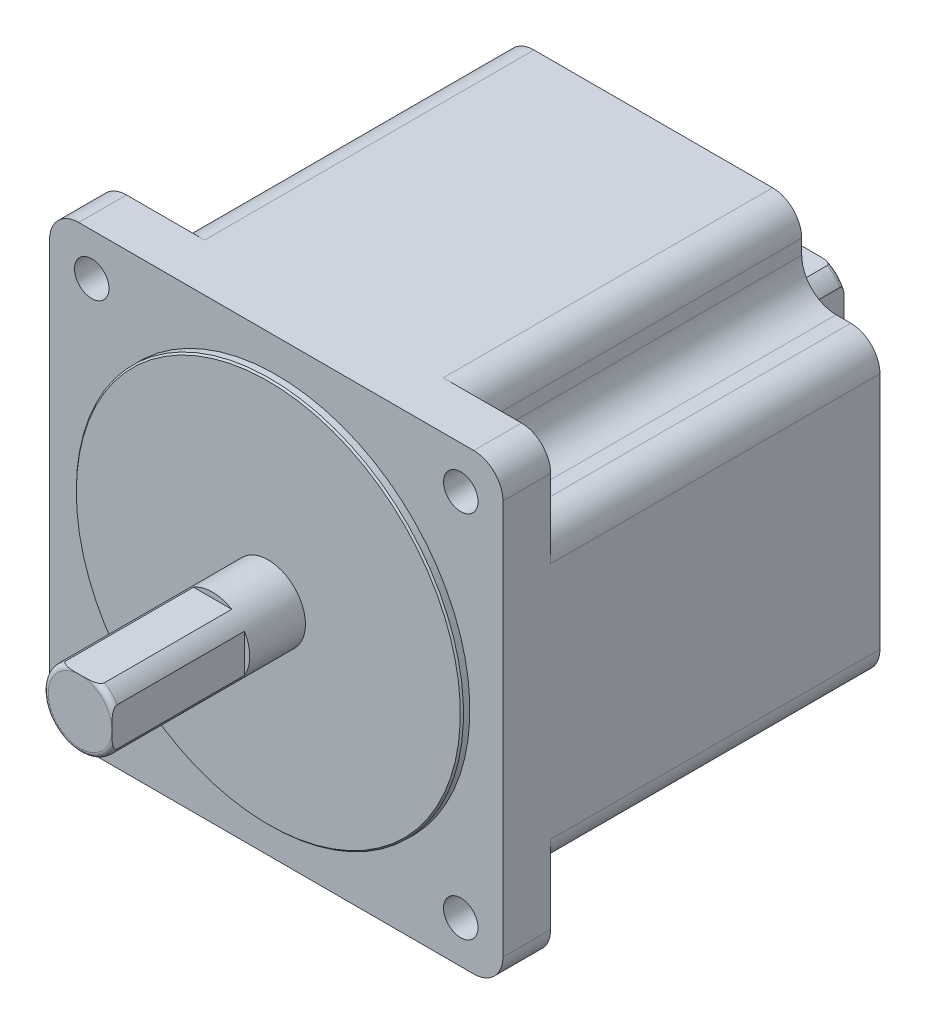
ISO-10303-21;
HEADER;
FILE_DESCRIPTION(('STEP AP214'),'2;1');
FILE_NAME('part.step','',(''),(''),'','','');
FILE_SCHEMA(('AUTOMOTIVE_DESIGN { 1 0 10303 214 1 1 1 1 }'));
ENDSEC;
DATA;
#1=APPLICATION_CONTEXT('core data for automotive mechanical design processes');
#2=APPLICATION_PROTOCOL_DEFINITION('international standard','automotive_design',2000,#1);
#3=PRODUCT_CONTEXT('',#1,'mechanical');
#4=PRODUCT('Part','Part','',(#3));
#5=PRODUCT_RELATED_PRODUCT_CATEGORY('part','',(#4));
#6=PRODUCT_DEFINITION_FORMATION('','',#4);
#7=PRODUCT_DEFINITION_CONTEXT('part definition',#1,'design');
#8=PRODUCT_DEFINITION('design','',#6,#7);
#9=PRODUCT_DEFINITION_SHAPE('','',#8);
#10=(LENGTH_UNIT() NAMED_UNIT(*) SI_UNIT(.MILLI.,.METRE.));
#11=(NAMED_UNIT(*) PLANE_ANGLE_UNIT() SI_UNIT($,.RADIAN.));
#12=(NAMED_UNIT(*) SI_UNIT($,.STERADIAN.) SOLID_ANGLE_UNIT());
#13=UNCERTAINTY_MEASURE_WITH_UNIT(LENGTH_MEASURE(1.E-05),#10,'distance_accuracy_value','');
#14=(GEOMETRIC_REPRESENTATION_CONTEXT(3) GLOBAL_UNCERTAINTY_ASSIGNED_CONTEXT((#13)) GLOBAL_UNIT_ASSIGNED_CONTEXT((#10,
#11,#12)) REPRESENTATION_CONTEXT('',''));
#15=CARTESIAN_POINT('',(0.,0.,0.));
#16=DIRECTION('',(0.,0.,1.));
#17=DIRECTION('',(1.,0.,0.));
#18=AXIS2_PLACEMENT_3D('',#15,#16,#17);
#19=CARTESIAN_POINT('',(0.,0.,-102.6));
#20=DIRECTION('',(0.,0.,1.));
#21=DIRECTION('',(1.,0.,0.));
#22=AXIS2_PLACEMENT_3D('',#19,#20,#21);
#23=CYLINDRICAL_SURFACE('',#22,7.);
#24=CARTESIAN_POINT('',(0.,0.,-101.8));
#25=DIRECTION('',(0.,0.,-1.));
#26=DIRECTION('',(-1.,0.,0.));
#27=AXIS2_PLACEMENT_3D('',#24,#25,#26);
#28=CIRCLE('',#27,7.);
#29=CARTESIAN_POINT('',(6.,3.60555127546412,-101.8));
#30=VERTEX_POINT('',#29);
#31=CARTESIAN_POINT('',(3.60555127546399,6.,-101.8));
#32=VERTEX_POINT('',#31);
#33=EDGE_CURVE('E486',#30,#32,#28,.F.);
#34=ORIENTED_EDGE('',*,*,#33,.T.);
#35=DIRECTION('',(0.,0.,1.));
#36=VECTOR('',#35,1.);
#37=CARTESIAN_POINT('',(3.60555127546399,6.,-102.6));
#38=LINE('',#37,#36);
#39=CARTESIAN_POINT('',(3.60555127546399,6.,-77.6));
#40=VERTEX_POINT('',#39);
#41=EDGE_CURVE('E162',#32,#40,#38,.T.);
#42=ORIENTED_EDGE('',*,*,#41,.T.);
#43=CARTESIAN_POINT('',(0.,0.,-77.6));
#44=DIRECTION('',(0.,0.,-1.));
#45=DIRECTION('',(-1.,0.,0.));
#46=AXIS2_PLACEMENT_3D('',#43,#44,#45);
#47=CIRCLE('',#46,7.);
#48=CARTESIAN_POINT('',(-3.60555127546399,6.,-77.6));
#49=VERTEX_POINT('',#48);
#50=EDGE_CURVE('E12',#49,#40,#47,.T.);
#51=ORIENTED_EDGE('',*,*,#50,.F.);
#52=DIRECTION('',(0.,0.,1.));
#53=VECTOR('',#52,1.);
#54=CARTESIAN_POINT('',(-3.60555127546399,6.,-102.6));
#55=LINE('',#54,#53);
#56=CARTESIAN_POINT('',(-3.60555127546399,6.,-101.8));
#57=VERTEX_POINT('',#56);
#58=EDGE_CURVE('E1474',#49,#57,#55,.F.);
#59=ORIENTED_EDGE('',*,*,#58,.T.);
#60=CARTESIAN_POINT('',(6.,-3.60555127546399,-101.8));
#61=VERTEX_POINT('',#60);
#62=EDGE_CURVE('E480',#57,#61,#28,.F.);
#63=ORIENTED_EDGE('',*,*,#62,.T.);
#64=DIRECTION('',(0.,0.,1.));
#65=VECTOR('',#64,1.);
#66=CARTESIAN_POINT('',(6.,-3.60555127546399,-102.6));
#67=LINE('',#66,#65);
#68=CARTESIAN_POINT('',(6.,-3.60555127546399,-77.6));
#69=VERTEX_POINT('',#68);
#70=EDGE_CURVE('E458',#69,#61,#67,.F.);
#71=ORIENTED_EDGE('',*,*,#70,.F.);
#72=CARTESIAN_POINT('',(6.,3.60555127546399,-77.6));
#73=VERTEX_POINT('',#72);
#74=EDGE_CURVE('E143',#73,#69,#47,.T.);
#75=ORIENTED_EDGE('',*,*,#74,.F.);
#76=DIRECTION('',(0.,0.,1.));
#77=VECTOR('',#76,1.);
#78=CARTESIAN_POINT('',(6.,3.60555127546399,-102.6));
#79=LINE('',#78,#77);
#80=EDGE_CURVE('E1476',#30,#73,#79,.T.);
#81=ORIENTED_EDGE('',*,*,#80,.F.);
#82=EDGE_LOOP('',(#34,#42,#51,#59,#63,#71,#75,#81));
#83=FACE_BOUND('',#82,.T.);
#84=CARTESIAN_POINT('',(0.,0.,-72.6));
#85=DIRECTION('',(0.,0.,-1.));
#86=DIRECTION('',(-1.,0.,0.));
#87=AXIS2_PLACEMENT_3D('',#84,#85,#86);
#88=CIRCLE('',#87,7.);
#89=CARTESIAN_POINT('',(-7.,0.,-72.6));
#90=VERTEX_POINT('',#89);
#91=EDGE_CURVE('E583',#90,#90,#88,.T.);
#92=ORIENTED_EDGE('',*,*,#91,.T.);
#93=EDGE_LOOP('',(#92));
#94=FACE_BOUND('',#93,.T.);
#95=ADVANCED_FACE('F138',(#83,#94),#23,.T.);
#96=CARTESIAN_POINT('',(0.,0.,-102.6));
#97=DIRECTION('',(0.,0.,-1.));
#98=DIRECTION('',(-1.,0.,0.));
#99=AXIS2_PLACEMENT_3D('',#96,#97,#98);
#100=PLANE('',#99);
#101=DIRECTION('',(-1.,0.,0.));
#102=VECTOR('',#101,1.);
#103=CARTESIAN_POINT('',(0.,6.,-102.6));
#104=LINE('',#103,#102);
#105=CARTESIAN_POINT('',(1.56204993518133,6.,-102.6));
#106=VERTEX_POINT('',#105);
#107=CARTESIAN_POINT('',(-1.56204993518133,6.,-102.6));
#108=VERTEX_POINT('',#107);
#109=EDGE_CURVE('E1477',#106,#108,#104,.T.);
#110=ORIENTED_EDGE('',*,*,#109,.F.);
#111=CARTESIAN_POINT('',(0.,0.,-102.6));
#112=DIRECTION('',(0.,0.,-1.));
#113=DIRECTION('',(-1.,0.,0.));
#114=AXIS2_PLACEMENT_3D('',#111,#112,#113);
#115=CIRCLE('',#114,6.2);
#116=CARTESIAN_POINT('',(6.,1.56204993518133,-102.6));
#117=VERTEX_POINT('',#116);
#118=EDGE_CURVE('E473',#106,#117,#115,.T.);
#119=ORIENTED_EDGE('',*,*,#118,.T.);
#120=DIRECTION('',(0.,-1.,0.));
#121=VECTOR('',#120,1.);
#122=CARTESIAN_POINT('',(6.,0.,-102.6));
#123=LINE('',#122,#121);
#124=CARTESIAN_POINT('',(6.,-1.56204993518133,-102.6));
#125=VERTEX_POINT('',#124);
#126=EDGE_CURVE('E154',#117,#125,#123,.T.);
#127=ORIENTED_EDGE('',*,*,#126,.T.);
#128=EDGE_CURVE('E471',#125,#108,#115,.T.);
#129=ORIENTED_EDGE('',*,*,#128,.T.);
#130=EDGE_LOOP('',(#110,#119,#127,#129));
#131=FACE_BOUND('',#130,.T.);
#132=ADVANCED_FACE('F470',(#131),#100,.T.);
#133=CARTESIAN_POINT('',(0.,0.,-101.8));
#134=DIRECTION('',(0.,0.,-1.));
#135=DIRECTION('',(-1.,0.,0.));
#136=AXIS2_PLACEMENT_3D('',#133,#134,#135);
#137=TOROIDAL_SURFACE('',#136,6.2,0.8);
#138=CARTESIAN_POINT('',(-0.485270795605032,6.,-102.579392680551));
#139=CARTESIAN_POINT('',(-0.618493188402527,6.,-102.581882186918));
#140=CARTESIAN_POINT('',(-0.75169852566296,6.,-102.585182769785));
#141=CARTESIAN_POINT('',(-1.01814605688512,6.,-102.5918393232));
#142=CARTESIAN_POINT('',(-1.15138825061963,6.,-102.595195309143));
#143=CARTESIAN_POINT('',(-1.41817812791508,6.,-102.599678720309));
#144=CARTESIAN_POINT('',(-1.5517259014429,6.,-102.600801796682));
#145=CARTESIAN_POINT('',(-1.81875254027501,6.,-102.597903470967));
#146=CARTESIAN_POINT('',(-1.95223140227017,6.,-102.593884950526));
#147=CARTESIAN_POINT('',(-2.1525496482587,6.,-102.581139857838));
#148=CARTESIAN_POINT('',(-2.21959289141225,6.,-102.575738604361));
#149=CARTESIAN_POINT('',(-2.35337842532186,6.,-102.562053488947));
#150=CARTESIAN_POINT('',(-2.42012078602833,6.,-102.55377033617));
#151=CARTESIAN_POINT('',(-2.55284272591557,6.,-102.533624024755));
#152=CARTESIAN_POINT('',(-2.61882413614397,6.,-102.521773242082));
#153=CARTESIAN_POINT('',(-2.74980040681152,6.,-102.49357506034));
#154=CARTESIAN_POINT('',(-2.81479595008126,6.,-102.477230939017));
#155=CARTESIAN_POINT('',(-2.93441731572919,6.,-102.441453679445));
#156=CARTESIAN_POINT('',(-2.9892545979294,6.,-102.422739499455));
#157=CARTESIAN_POINT('',(-3.09704641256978,6.,-102.37996651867));
#158=CARTESIAN_POINT('',(-3.14999509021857,6.,-102.35589253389));
#159=CARTESIAN_POINT('',(-3.25315536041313,6.,-102.300724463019));
#160=CARTESIAN_POINT('',(-3.30331698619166,6.,-102.269534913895));
#161=CARTESIAN_POINT('',(-3.39719193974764,6.,-102.198643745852));
#162=CARTESIAN_POINT('',(-3.44094249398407,6.,-102.158994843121));
#163=CARTESIAN_POINT('',(-3.4969863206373,6.,-102.093208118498));
#164=CARTESIAN_POINT('',(-3.5137456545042,6.,-102.070886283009));
#165=CARTESIAN_POINT('',(-3.54382531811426,6.,-102.024000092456));
#166=CARTESIAN_POINT('',(-3.55714676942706,6.,-101.999436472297));
#167=CARTESIAN_POINT('',(-3.57951911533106,6.,-101.948076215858));
#168=CARTESIAN_POINT('',(-3.58852199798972,6.,-101.921258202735));
#169=CARTESIAN_POINT('',(-3.60112191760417,6.,-101.866381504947));
#170=CARTESIAN_POINT('',(-3.60472621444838,6.,-101.838324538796));
#171=CARTESIAN_POINT('',(-3.60603762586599,6.,-101.785545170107));
#172=CARTESIAN_POINT('',(-3.60441630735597,6.,-101.7608376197));
#173=CARTESIAN_POINT('',(-3.5968692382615,6.,-101.712090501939));
#174=CARTESIAN_POINT('',(-3.59094198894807,6.,-101.68805117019));
#175=CARTESIAN_POINT('',(-3.57556208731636,6.,-101.642101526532));
#176=CARTESIAN_POINT('',(-3.5662419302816,6.,-101.620145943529));
#177=CARTESIAN_POINT('',(-3.54465453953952,6.,-101.577757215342));
#178=CARTESIAN_POINT('',(-3.53238674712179,6.,-101.557324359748));
#179=CARTESIAN_POINT('',(-3.49673875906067,6.,-101.505357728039));
#180=CARTESIAN_POINT('',(-3.47131413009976,6.,-101.475226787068));
#181=CARTESIAN_POINT('',(-3.41608760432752,6.,-101.41925352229));
#182=CARTESIAN_POINT('',(-3.38627063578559,6.,-101.393426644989));
#183=CARTESIAN_POINT('',(-3.30186141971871,6.,-101.328882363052));
#184=CARTESIAN_POINT('',(-3.244526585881,6.,-101.29378275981));
#185=CARTESIAN_POINT('',(-3.12560762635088,6.,-101.232218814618));
#186=CARTESIAN_POINT('',(-3.06402084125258,6.,-101.205759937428));
#187=CARTESIAN_POINT('',(-2.92063417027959,6.,-101.152897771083));
#188=CARTESIAN_POINT('',(-2.83805677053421,6.,-101.128639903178));
#189=CARTESIAN_POINT('',(-2.67091767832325,6.,-101.088106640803));
#190=CARTESIAN_POINT('',(-2.58635250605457,6.,-101.07184653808));
#191=CARTESIAN_POINT('',(-2.41550414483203,6.,-101.045202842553));
#192=CARTESIAN_POINT('',(-2.32921225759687,6.,-101.034877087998));
#193=CARTESIAN_POINT('',(-2.15632310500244,6.,-101.018793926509));
#194=CARTESIAN_POINT('',(-2.06972625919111,6.,-101.013031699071));
#195=CARTESIAN_POINT('',(-1.88956616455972,6.,-101.004511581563));
#196=CARTESIAN_POINT('',(-1.79599109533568,6.,-101.002025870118));
#197=CARTESIAN_POINT('',(-1.6088032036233,6.,-100.999671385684));
#198=CARTESIAN_POINT('',(-1.51519037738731,6.,-100.999803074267));
#199=CARTESIAN_POINT('',(-1.32791166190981,6.,-101.001633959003));
#200=CARTESIAN_POINT('',(-1.2342457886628,6.,-101.003334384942));
#201=CARTESIAN_POINT('',(-1.04692816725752,6.,-101.007408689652));
#202=CARTESIAN_POINT('',(-0.953276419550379,6.,-101.009782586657));
#203=CARTESIAN_POINT('',(-0.765693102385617,6.,-101.014466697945));
#204=CARTESIAN_POINT('',(-0.671761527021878,6.,-101.016776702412));
#205=CARTESIAN_POINT('',(-0.483883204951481,6.,-101.020747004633));
#206=CARTESIAN_POINT('',(-0.389936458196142,6.,-101.022407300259));
#207=CARTESIAN_POINT('',(-0.202106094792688,6.,-101.024703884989));
#208=CARTESIAN_POINT('',(-0.10822248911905,6.,-101.025341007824));
#209=CARTESIAN_POINT('',(0.0795447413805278,6.,-101.025456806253));
#210=CARTESIAN_POINT('',(0.173428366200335,6.,-101.024935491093));
#211=CARTESIAN_POINT('',(0.360161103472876,6.,-101.022857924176));
#212=CARTESIAN_POINT('',(0.453010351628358,6.,-101.021313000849));
#213=CARTESIAN_POINT('',(0.638696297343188,6.,-101.017536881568));
#214=CARTESIAN_POINT('',(0.731532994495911,6.,-101.015305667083));
#215=CARTESIAN_POINT('',(0.917332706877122,6.,-101.0106903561));
#216=CARTESIAN_POINT('',(1.01029571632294,6.,-101.008306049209));
#217=CARTESIAN_POINT('',(1.19624163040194,6.,-101.004094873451));
#218=CARTESIAN_POINT('',(1.28922453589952,6.,-101.002268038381));
#219=CARTESIAN_POINT('',(1.47469216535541,6.,-101.000034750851));
#220=CARTESIAN_POINT('',(1.56717677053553,6.,-100.999620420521));
#221=CARTESIAN_POINT('',(1.75212153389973,6.,-101.001180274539));
#222=CARTESIAN_POINT('',(1.844581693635,6.,-101.003154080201));
#223=CARTESIAN_POINT('',(2.02917883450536,6.,-101.01065514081));
#224=CARTESIAN_POINT('',(2.12131608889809,6.,-101.016175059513));
#225=CARTESIAN_POINT('',(2.30514593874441,6.,-101.032177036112));
#226=CARTESIAN_POINT('',(2.39683877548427,6.,-101.042656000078));
#227=CARTESIAN_POINT('',(2.52748287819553,6.,-101.062544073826));
#228=CARTESIAN_POINT('',(2.56685652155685,6.,-101.069190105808));
#229=CARTESIAN_POINT('',(2.64535310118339,6.,-101.083953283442));
#230=CARTESIAN_POINT('',(2.68447587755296,6.,-101.092071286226));
#231=CARTESIAN_POINT('',(2.76244729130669,6.,-101.110013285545));
#232=CARTESIAN_POINT('',(2.80129491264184,6.,-101.119841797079));
#233=CARTESIAN_POINT('',(2.87842421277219,6.,-101.141442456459));
#234=CARTESIAN_POINT('',(2.91670600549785,6.,-101.153214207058));
#235=CARTESIAN_POINT('',(3.03157772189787,6.,-101.192267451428));
#236=CARTESIAN_POINT('',(3.10709746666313,6.,-101.2230537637));
#237=CARTESIAN_POINT('',(3.21541606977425,6.,-101.278528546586));
#238=CARTESIAN_POINT('',(3.25062687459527,6.,-101.298517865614));
#239=CARTESIAN_POINT('',(3.31868978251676,6.,-101.342141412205));
#240=CARTESIAN_POINT('',(3.35154584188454,6.,-101.365769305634));
#241=CARTESIAN_POINT('',(3.40647692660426,6.,-101.411198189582));
#242=CARTESIAN_POINT('',(3.42927092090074,6.,-101.432123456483));
#243=CARTESIAN_POINT('',(3.47209230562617,6.,-101.476693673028));
#244=CARTESIAN_POINT('',(3.49211879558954,6.,-101.500339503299));
#245=CARTESIAN_POINT('',(3.52858598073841,6.,-101.550727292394));
#246=CARTESIAN_POINT('',(3.54498203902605,6.,-101.577502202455));
#247=CARTESIAN_POINT('',(3.57253222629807,6.,-101.63363076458));
#248=CARTESIAN_POINT('',(3.58369824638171,6.,-101.662978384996));
#249=CARTESIAN_POINT('',(3.59760273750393,6.,-101.715964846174));
#250=CARTESIAN_POINT('',(3.60173644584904,6.,-101.739238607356));
#251=CARTESIAN_POINT('',(3.6059861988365,6.,-101.786149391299));
#252=CARTESIAN_POINT('',(3.60610436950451,6.,-101.809786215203));
#253=CARTESIAN_POINT('',(3.60231413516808,6.,-101.856707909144));
#254=CARTESIAN_POINT('',(3.59840914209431,6.,-101.879993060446));
#255=CARTESIAN_POINT('',(3.58690158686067,6.,-101.925626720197));
#256=CARTESIAN_POINT('',(3.57929649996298,6.,-101.947974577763));
#257=CARTESIAN_POINT('',(3.55800797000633,6.,-101.998138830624));
#258=CARTESIAN_POINT('',(3.54316456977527,6.,-102.025461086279));
#259=CARTESIAN_POINT('',(3.50927363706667,6.,-102.077352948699));
#260=CARTESIAN_POINT('',(3.49021755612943,6.,-102.10191680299));
#261=CARTESIAN_POINT('',(3.43830757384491,6.,-102.160349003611));
#262=CARTESIAN_POINT('',(3.40343347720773,6.,-102.192408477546));
#263=CARTESIAN_POINT('',(3.3292980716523,6.,-102.250908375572));
#264=CARTESIAN_POINT('',(3.29002730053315,6.,-102.277336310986));
#265=CARTESIAN_POINT('',(3.21215770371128,6.,-102.323435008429));
#266=CARTESIAN_POINT('',(3.17378037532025,6.,-102.343487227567));
#267=CARTESIAN_POINT('',(3.09543949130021,6.,-102.380255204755));
#268=CARTESIAN_POINT('',(3.05547451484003,6.,-102.396967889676));
#269=CARTESIAN_POINT('',(2.97441243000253,6.,-102.427577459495));
#270=CARTESIAN_POINT('',(2.93331342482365,6.,-102.441469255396));
#271=CARTESIAN_POINT('',(2.8504065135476,6.,-102.466810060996));
#272=CARTESIAN_POINT('',(2.80859904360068,6.,-102.478260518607));
#273=CARTESIAN_POINT('',(2.68190249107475,6.,-102.509628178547));
#274=CARTESIAN_POINT('',(2.59623113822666,6.,-102.52638700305));
#275=CARTESIAN_POINT('',(2.42388080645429,6.,-102.553694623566));
#276=CARTESIAN_POINT('',(2.33720083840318,6.,-102.564236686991));
#277=CARTESIAN_POINT('',(2.16312068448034,6.,-102.58070518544));
#278=CARTESIAN_POINT('',(2.07571904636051,6.,-102.58661560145));
#279=CARTESIAN_POINT('',(1.90074424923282,6.,-102.59502506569));
#280=CARTESIAN_POINT('',(1.81317104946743,6.,-102.597523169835));
#281=CARTESIAN_POINT('',(1.63734126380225,6.,-102.600151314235));
#282=CARTESIAN_POINT('',(1.54908447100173,6.,-102.600263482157));
#283=CARTESIAN_POINT('',(1.37258075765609,6.,-102.59897223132));
#284=CARTESIAN_POINT('',(1.28433383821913,6.,-102.59756870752));
#285=CARTESIAN_POINT('',(1.10802656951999,6.,-102.594019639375));
#286=CARTESIAN_POINT('',(1.0199661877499,6.,-102.59187552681));
#287=CARTESIAN_POINT('',(0.843851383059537,6.,-102.587492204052));
#288=CARTESIAN_POINT('',(0.755796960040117,6.,-102.585252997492));
#289=CARTESIAN_POINT('',(0.57152047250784,6.,-102.58101343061));
#290=CARTESIAN_POINT('',(0.475297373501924,6.,-102.579054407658));
#291=CARTESIAN_POINT('',(0.28279999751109,6.,-102.576119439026));
#292=CARTESIAN_POINT('',(0.186525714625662,6.,-102.575143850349));
#293=CARTESIAN_POINT('',(-0.00568268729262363,6.,-102.574400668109));
#294=CARTESIAN_POINT('',(-0.101616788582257,6.,-102.574628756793));
#295=CARTESIAN_POINT('',(-0.293460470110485,6.,-102.576228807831));
#296=CARTESIAN_POINT('',(-0.389370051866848,6.,-102.577600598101));
#297=CARTESIAN_POINT('',(-0.485270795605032,6.,-102.579392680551));
#298=B_SPLINE_CURVE_WITH_KNOTS('',3,(#138,#139,#140,#141,#142,#143,#144,#145,#146,#147,#148,
#149,#150,#151,#152,#153,#154,#155,#156,#157,#158,#159,#160,#161,#162,#163,#164,#165,#166,#167,
#168,#169,#170,#171,#172,#173,#174,#175,#176,#177,#178,#179,#180,#181,#182,#183,#184,#185,#186,
#187,#188,#189,#190,#191,#192,#193,#194,#195,#196,#197,#198,#199,#200,#201,#202,#203,#204,#205,
#206,#207,#208,#209,#210,#211,#212,#213,#214,#215,#216,#217,#218,#219,#220,#221,#222,#223,#224,
#225,#226,#227,#228,#229,#230,#231,#232,#233,#234,#235,#236,#237,#238,#239,#240,#241,#242,#243,
#244,#245,#246,#247,#248,#249,#250,#251,#252,#253,#254,#255,#256,#257,#258,#259,#260,#261,#262,
#263,#264,#265,#266,#267,#268,#269,#270,#271,#272,#273,#274,#275,#276,#277,#278,#279,#280,#281,
#282,#283,#284,#285,#286,#287,#288,#289,#290,#291,#292,#293,#294,#295,#296,#297),.UNSPECIFIED.,
.T.,.F.,(4,2,2,2,2,2,2,2,2,2,2,2,2,2,2,2,2,2,2,2,2,2,2,2,2,2,2,2,2,2,2,2,2,2,2,2,2,2,2,2,2,2,2,
2,2,2,2,2,2,2,2,2,2,2,2,2,2,2,2,2,2,2,2,2,2,2,2,2,2,2,2,2,2,2,2,2,2,2,2,4),(0.,
0.399736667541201,0.79958635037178,1.2002140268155,1.60061726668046,1.80235120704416,
2.00403554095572,2.20502814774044,2.40587452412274,2.5794978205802,2.75361938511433,
2.93023084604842,3.10577228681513,3.18927272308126,3.27274588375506,3.35712670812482,
3.44139395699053,3.51528383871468,3.58919945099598,3.66049342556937,3.73180092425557,
3.84939158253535,3.96739556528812,4.16793128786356,4.3685935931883,4.62618499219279,
4.88426701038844,5.14482349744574,5.40510438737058,5.68587256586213,5.96669025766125,
6.24772827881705,6.52877390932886,6.81065330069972,7.09253361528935,7.374184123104,
7.65583238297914,7.93441453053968,8.21300420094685,8.49198528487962,8.77098327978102,
9.0484226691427,9.32581807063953,9.60264143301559,9.87929231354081,9.99906133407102,
10.1189003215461,10.2390605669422,10.359196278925,10.6028176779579,10.724121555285,
10.8452166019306,10.937851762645,11.0305169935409,11.1242650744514,11.2177989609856,
11.2883939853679,11.3589516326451,11.4294494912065,11.4999955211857,11.59275750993,
11.6857094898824,11.827025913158,11.968652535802,12.0983623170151,12.2281909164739,
12.3582516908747,12.4882351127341,12.749760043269,13.0115676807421,13.2742768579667,
13.5370587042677,13.8018082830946,14.0665762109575,14.3308351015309,14.5950839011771,
14.8838100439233,15.1726409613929,15.4604365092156,15.748188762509),.UNSPECIFIED.);
#299=EDGE_CURVE('E477',#108,#57,#298,.T.);
#300=ORIENTED_EDGE('',*,*,#299,.F.);
#301=ORIENTED_EDGE('',*,*,#128,.F.);
#302=CARTESIAN_POINT('',(6.,-0.485270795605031,-102.579392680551));
#303=CARTESIAN_POINT('',(6.,-0.618493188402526,-102.581882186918));
#304=CARTESIAN_POINT('',(6.,-0.751698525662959,-102.585182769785));
#305=CARTESIAN_POINT('',(6.,-1.01814605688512,-102.5918393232));
#306=CARTESIAN_POINT('',(6.,-1.15138825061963,-102.595195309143));
#307=CARTESIAN_POINT('',(6.,-1.41817812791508,-102.599678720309));
#308=CARTESIAN_POINT('',(6.,-1.5517259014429,-102.600801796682));
#309=CARTESIAN_POINT('',(6.,-1.818752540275,-102.597903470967));
#310=CARTESIAN_POINT('',(6.,-1.95223140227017,-102.593884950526));
#311=CARTESIAN_POINT('',(6.,-2.1525496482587,-102.581139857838));
#312=CARTESIAN_POINT('',(6.,-2.21959289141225,-102.575738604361));
#313=CARTESIAN_POINT('',(6.,-2.35337842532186,-102.562053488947));
#314=CARTESIAN_POINT('',(6.,-2.42012078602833,-102.55377033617));
#315=CARTESIAN_POINT('',(6.,-2.55284272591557,-102.533624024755));
#316=CARTESIAN_POINT('',(6.,-2.61882413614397,-102.521773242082));
#317=CARTESIAN_POINT('',(6.,-2.74980040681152,-102.49357506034));
#318=CARTESIAN_POINT('',(6.,-2.81479595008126,-102.477230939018));
#319=CARTESIAN_POINT('',(6.,-2.93441731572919,-102.441453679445));
#320=CARTESIAN_POINT('',(6.,-2.9892545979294,-102.422739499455));
#321=CARTESIAN_POINT('',(6.,-3.09704641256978,-102.37996651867));
#322=CARTESIAN_POINT('',(6.,-3.14999509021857,-102.35589253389));
#323=CARTESIAN_POINT('',(6.,-3.25315536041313,-102.300724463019));
#324=CARTESIAN_POINT('',(6.,-3.30331698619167,-102.269534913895));
#325=CARTESIAN_POINT('',(6.,-3.39719193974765,-102.198643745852));
#326=CARTESIAN_POINT('',(6.,-3.44094249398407,-102.158994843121));
#327=CARTESIAN_POINT('',(6.,-3.4969863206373,-102.093208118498));
#328=CARTESIAN_POINT('',(6.,-3.51374565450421,-102.070886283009));
#329=CARTESIAN_POINT('',(6.,-3.54382531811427,-102.024000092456));
#330=CARTESIAN_POINT('',(6.,-3.55714676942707,-101.999436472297));
#331=CARTESIAN_POINT('',(6.,-3.57951911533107,-101.948076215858));
#332=CARTESIAN_POINT('',(6.,-3.58852199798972,-101.921258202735));
#333=CARTESIAN_POINT('',(6.,-3.60112191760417,-101.866381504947));
#334=CARTESIAN_POINT('',(6.,-3.60472621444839,-101.838324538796));
#335=CARTESIAN_POINT('',(6.,-3.60603762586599,-101.785545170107));
#336=CARTESIAN_POINT('',(6.,-3.60441630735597,-101.7608376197));
#337=CARTESIAN_POINT('',(6.,-3.5968692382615,-101.712090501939));
#338=CARTESIAN_POINT('',(6.,-3.59094198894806,-101.68805117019));
#339=CARTESIAN_POINT('',(6.,-3.57556208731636,-101.642101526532));
#340=CARTESIAN_POINT('',(6.,-3.5662419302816,-101.620145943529));
#341=CARTESIAN_POINT('',(6.,-3.54465453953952,-101.577757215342));
#342=CARTESIAN_POINT('',(6.,-3.53238674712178,-101.557324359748));
#343=CARTESIAN_POINT('',(6.,-3.49673875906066,-101.505357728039));
#344=CARTESIAN_POINT('',(6.,-3.47131413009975,-101.475226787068));
#345=CARTESIAN_POINT('',(6.,-3.4160876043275,-101.41925352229));
#346=CARTESIAN_POINT('',(6.,-3.38627063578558,-101.393426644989));
#347=CARTESIAN_POINT('',(6.,-3.30186141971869,-101.328882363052));
#348=CARTESIAN_POINT('',(6.,-3.24452658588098,-101.29378275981));
#349=CARTESIAN_POINT('',(6.,-3.12560762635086,-101.232218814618));
#350=CARTESIAN_POINT('',(6.,-3.06402084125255,-101.205759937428));
#351=CARTESIAN_POINT('',(6.,-2.92063417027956,-101.152897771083));
#352=CARTESIAN_POINT('',(6.,-2.83805677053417,-101.128639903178));
#353=CARTESIAN_POINT('',(6.,-2.67091767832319,-101.088106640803));
#354=CARTESIAN_POINT('',(6.,-2.58635250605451,-101.07184653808));
#355=CARTESIAN_POINT('',(6.,-2.41550414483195,-101.045202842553));
#356=CARTESIAN_POINT('',(6.,-2.32921225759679,-101.034877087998));
#357=CARTESIAN_POINT('',(6.,-2.15632310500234,-101.018793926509));
#358=CARTESIAN_POINT('',(6.,-2.06972625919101,-101.013031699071));
#359=CARTESIAN_POINT('',(6.,-1.8895661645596,-101.004511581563));
#360=CARTESIAN_POINT('',(6.,-1.79599109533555,-101.002025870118));
#361=CARTESIAN_POINT('',(6.,-1.60880320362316,-100.999671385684));
#362=CARTESIAN_POINT('',(6.,-1.51519037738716,-100.999803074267));
#363=CARTESIAN_POINT('',(6.,-1.32791166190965,-101.001633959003));
#364=CARTESIAN_POINT('',(6.,-1.23424578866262,-101.003334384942));
#365=CARTESIAN_POINT('',(6.,-1.04692816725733,-101.007408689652));
#366=CARTESIAN_POINT('',(6.,-0.95327641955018,-101.009782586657));
#367=CARTESIAN_POINT('',(6.,-0.765693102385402,-101.014466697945));
#368=CARTESIAN_POINT('',(6.,-0.671761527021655,-101.016776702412));
#369=CARTESIAN_POINT('',(6.,-0.483883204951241,-101.020747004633));
#370=CARTESIAN_POINT('',(6.,-0.389936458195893,-101.022407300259));
#371=CARTESIAN_POINT('',(6.,-0.202106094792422,-101.024703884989));
#372=CARTESIAN_POINT('',(6.,-0.108222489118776,-101.025341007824));
#373=CARTESIAN_POINT('',(6.,0.0795447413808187,-101.025456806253));
#374=CARTESIAN_POINT('',(6.,0.173428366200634,-101.024935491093));
#375=CARTESIAN_POINT('',(6.,0.360161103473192,-101.022857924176));
#376=CARTESIAN_POINT('',(6.,0.453010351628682,-101.021313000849));
#377=CARTESIAN_POINT('',(6.,0.638696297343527,-101.017536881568));
#378=CARTESIAN_POINT('',(6.,0.731532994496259,-101.015305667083));
#379=CARTESIAN_POINT('',(6.,0.917332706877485,-101.0106903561));
#380=CARTESIAN_POINT('',(6.,1.01029571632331,-101.008306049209));
#381=CARTESIAN_POINT('',(6.,1.19624163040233,-101.004094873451));
#382=CARTESIAN_POINT('',(6.,1.28922453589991,-101.002268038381));
#383=CARTESIAN_POINT('',(6.,1.47469216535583,-101.000034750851));
#384=CARTESIAN_POINT('',(6.,1.56717677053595,-100.999620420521));
#385=CARTESIAN_POINT('',(6.,1.75212153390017,-101.001180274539));
#386=CARTESIAN_POINT('',(6.,1.84458169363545,-101.003154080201));
#387=CARTESIAN_POINT('',(6.,2.02917883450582,-101.01065514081));
#388=CARTESIAN_POINT('',(6.,2.12131608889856,-101.016175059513));
#389=CARTESIAN_POINT('',(6.,2.30514593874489,-101.032177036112));
#390=CARTESIAN_POINT('',(6.,2.39683877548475,-101.042656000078));
#391=CARTESIAN_POINT('',(6.,2.52748287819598,-101.062544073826));
#392=CARTESIAN_POINT('',(6.,2.56685652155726,-101.069190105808));
#393=CARTESIAN_POINT('',(6.,2.64535310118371,-101.083953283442));
#394=CARTESIAN_POINT('',(6.,2.68447587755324,-101.092071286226));
#395=CARTESIAN_POINT('',(6.,2.76244729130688,-101.110013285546));
#396=CARTESIAN_POINT('',(6.,2.80129491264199,-101.119841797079));
#397=CARTESIAN_POINT('',(6.,2.87842421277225,-101.141442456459));
#398=CARTESIAN_POINT('',(6.,2.91670600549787,-101.153214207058));
#399=CARTESIAN_POINT('',(6.,3.03157772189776,-101.192267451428));
#400=CARTESIAN_POINT('',(6.,3.10709746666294,-101.2230537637));
#401=CARTESIAN_POINT('',(6.,3.21541606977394,-101.278528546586));
#402=CARTESIAN_POINT('',(6.,3.25062687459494,-101.298517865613));
#403=CARTESIAN_POINT('',(6.,3.31868978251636,-101.342141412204));
#404=CARTESIAN_POINT('',(6.,3.35154584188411,-101.365769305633));
#405=CARTESIAN_POINT('',(6.,3.40647692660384,-101.411198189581));
#406=CARTESIAN_POINT('',(6.,3.42927092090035,-101.432123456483));
#407=CARTESIAN_POINT('',(6.,3.47209230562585,-101.476693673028));
#408=CARTESIAN_POINT('',(6.,3.49211879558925,-101.500339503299));
#409=CARTESIAN_POINT('',(6.,3.52858598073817,-101.550727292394));
#410=CARTESIAN_POINT('',(6.,3.54498203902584,-101.577502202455));
#411=CARTESIAN_POINT('',(6.,3.57253222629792,-101.63363076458));
#412=CARTESIAN_POINT('',(6.,3.5836982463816,-101.662978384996));
#413=CARTESIAN_POINT('',(6.,3.59760273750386,-101.715964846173));
#414=CARTESIAN_POINT('',(6.,3.60173644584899,-101.739238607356));
#415=CARTESIAN_POINT('',(6.,3.60598619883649,-101.786149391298));
#416=CARTESIAN_POINT('',(6.,3.60610436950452,-101.809786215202));
#417=CARTESIAN_POINT('',(6.,3.60231413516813,-101.856707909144));
#418=CARTESIAN_POINT('',(6.,3.59840914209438,-101.879993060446));
#419=CARTESIAN_POINT('',(6.,3.58690158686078,-101.925626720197));
#420=CARTESIAN_POINT('',(6.,3.5792964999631,-101.947974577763));
#421=CARTESIAN_POINT('',(6.,3.55800797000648,-101.998138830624));
#422=CARTESIAN_POINT('',(6.,3.54316456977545,-102.025461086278));
#423=CARTESIAN_POINT('',(6.,3.50927363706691,-102.077352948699));
#424=CARTESIAN_POINT('',(6.,3.4902175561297,-102.101916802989));
#425=CARTESIAN_POINT('',(6.,3.43830757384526,-102.16034900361));
#426=CARTESIAN_POINT('',(6.,3.40343347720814,-102.192408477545));
#427=CARTESIAN_POINT('',(6.,3.32929807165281,-102.250908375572));
#428=CARTESIAN_POINT('',(6.,3.29002730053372,-102.277336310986));
#429=CARTESIAN_POINT('',(6.,3.21215770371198,-102.323435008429));
#430=CARTESIAN_POINT('',(6.,3.17378037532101,-102.343487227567));
#431=CARTESIAN_POINT('',(6.,3.09543949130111,-102.380255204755));
#432=CARTESIAN_POINT('',(6.,3.05547451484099,-102.396967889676));
#433=CARTESIAN_POINT('',(6.,2.97441243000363,-102.427577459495));
#434=CARTESIAN_POINT('',(6.,2.93331342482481,-102.441469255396));
#435=CARTESIAN_POINT('',(6.,2.8504065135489,-102.466810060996));
#436=CARTESIAN_POINT('',(6.,2.80859904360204,-102.478260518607));
#437=CARTESIAN_POINT('',(6.,2.68190249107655,-102.509628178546));
#438=CARTESIAN_POINT('',(6.,2.59623113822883,-102.526387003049));
#439=CARTESIAN_POINT('',(6.,2.42388080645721,-102.553694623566));
#440=CARTESIAN_POINT('',(6.,2.33720083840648,-102.564236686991));
#441=CARTESIAN_POINT('',(6.,2.1631206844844,-102.58070518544));
#442=CARTESIAN_POINT('',(6.,2.07571904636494,-102.58661560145));
#443=CARTESIAN_POINT('',(6.,1.90074424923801,-102.59502506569));
#444=CARTESIAN_POINT('',(6.,1.813171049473,-102.597523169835));
#445=CARTESIAN_POINT('',(6.,1.63734126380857,-102.600151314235));
#446=CARTESIAN_POINT('',(6.,1.54908447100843,-102.600263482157));
#447=CARTESIAN_POINT('',(6.,1.37258075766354,-102.59897223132));
#448=CARTESIAN_POINT('',(6.,1.28433383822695,-102.59756870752));
#449=CARTESIAN_POINT('',(6.,1.10802656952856,-102.594019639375));
#450=CARTESIAN_POINT('',(6.,1.01996618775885,-102.591875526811));
#451=CARTESIAN_POINT('',(6.,0.84385138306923,-102.587492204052));
#452=CARTESIAN_POINT('',(6.,0.755796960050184,-102.585252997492));
#453=CARTESIAN_POINT('',(6.,0.571520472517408,-102.58101343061));
#454=CARTESIAN_POINT('',(6.,0.475297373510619,-102.579054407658));
#455=CARTESIAN_POINT('',(6.,0.282799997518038,-102.576119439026));
#456=CARTESIAN_POINT('',(6.,0.186525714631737,-102.575143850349));
#457=CARTESIAN_POINT('',(6.,-0.00568268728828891,-102.574400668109));
#458=CARTESIAN_POINT('',(6.,-0.10161678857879,-102.574628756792));
#459=CARTESIAN_POINT('',(6.,-0.293460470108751,-102.576228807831));
#460=CARTESIAN_POINT('',(6.,-0.389370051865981,-102.577600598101));
#461=CARTESIAN_POINT('',(6.,-0.485270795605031,-102.579392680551));
#462=B_SPLINE_CURVE_WITH_KNOTS('',3,(#302,#303,#304,#305,#306,#307,#308,#309,#310,#311,#312,
#313,#314,#315,#316,#317,#318,#319,#320,#321,#322,#323,#324,#325,#326,#327,#328,#329,#330,#331,
#332,#333,#334,#335,#336,#337,#338,#339,#340,#341,#342,#343,#344,#345,#346,#347,#348,#349,#350,
#351,#352,#353,#354,#355,#356,#357,#358,#359,#360,#361,#362,#363,#364,#365,#366,#367,#368,#369,
#370,#371,#372,#373,#374,#375,#376,#377,#378,#379,#380,#381,#382,#383,#384,#385,#386,#387,#388,
#389,#390,#391,#392,#393,#394,#395,#396,#397,#398,#399,#400,#401,#402,#403,#404,#405,#406,#407,
#408,#409,#410,#411,#412,#413,#414,#415,#416,#417,#418,#419,#420,#421,#422,#423,#424,#425,#426,
#427,#428,#429,#430,#431,#432,#433,#434,#435,#436,#437,#438,#439,#440,#441,#442,#443,#444,#445,
#446,#447,#448,#449,#450,#451,#452,#453,#454,#455,#456,#457,#458,#459,#460,#461),.UNSPECIFIED.,
.T.,.F.,(4,2,2,2,2,2,2,2,2,2,2,2,2,2,2,2,2,2,2,2,2,2,2,2,2,2,2,2,2,2,2,2,2,2,2,2,2,2,2,2,2,2,2,
2,2,2,2,2,2,2,2,2,2,2,2,2,2,2,2,2,2,2,2,2,2,2,2,2,2,2,2,2,2,2,2,2,2,2,2,4),(0.,
0.399736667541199,0.799586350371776,1.2002140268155,1.60061726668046,1.80235120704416,
2.00403554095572,2.20502814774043,2.40587452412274,2.5794978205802,2.75361938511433,
2.93023084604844,3.10577228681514,3.18927272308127,3.27274588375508,3.35712670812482,
3.44139395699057,3.51528383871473,3.58919945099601,3.66049342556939,3.7318009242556,
3.84939158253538,3.96739556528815,4.16793128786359,4.36859359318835,4.62618499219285,
4.88426701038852,5.14482349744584,5.4051043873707,5.68587256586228,5.96669025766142,
6.24772827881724,6.52877390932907,6.81065330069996,7.09253361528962,7.37418412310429,
7.65583238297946,7.93441453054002,8.21300420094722,8.49198528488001,8.77098327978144,
9.04842266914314,9.32581807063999,9.60264143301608,9.87929231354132,9.99906133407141,
10.1189003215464,10.2390605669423,10.359196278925,10.6028176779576,10.7241215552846,
10.84521660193,10.9378517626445,11.0305169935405,11.124265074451,11.2177989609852,
11.2883939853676,11.3589516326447,11.4294494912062,11.4999955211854,11.5927575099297,
11.685709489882,11.8270259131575,11.9686525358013,12.0983623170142,12.2281909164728,
12.3582516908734,12.4882351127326,12.7497600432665,13.0115676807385,13.2742768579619,
13.5370587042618,13.8018082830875,14.0665762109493,14.3308351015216,14.5950839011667,
14.8838100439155,15.1726409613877,15.460436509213,15.748188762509),.UNSPECIFIED.);
#463=EDGE_CURVE('E454',#125,#61,#462,.T.);
#464=ORIENTED_EDGE('',*,*,#463,.T.);
#465=ORIENTED_EDGE('',*,*,#62,.F.);
#466=EDGE_LOOP('',(#300,#301,#464,#465));
#467=FACE_BOUND('',#466,.T.);
#468=ADVANCED_FACE('F140',(#467),#137,.T.);
#469=EDGE_CURVE('E463',#32,#106,#298,.T.);
#470=ORIENTED_EDGE('',*,*,#469,.F.);
#471=ORIENTED_EDGE('',*,*,#33,.F.);
#472=EDGE_CURVE('E464',#30,#117,#462,.T.);
#473=ORIENTED_EDGE('',*,*,#472,.T.);
#474=ORIENTED_EDGE('',*,*,#118,.F.);
#475=EDGE_LOOP('',(#470,#471,#473,#474));
#476=FACE_BOUND('',#475,.T.);
#477=ADVANCED_FACE('F1069',(#476),#137,.T.);
#478=CARTESIAN_POINT('',(0.,0.,-72.6));
#479=DIRECTION('',(0.,0.,-1.));
#480=DIRECTION('',(-1.,0.,0.));
#481=AXIS2_PLACEMENT_3D('',#478,#479,#480);
#482=PLANE('',#481);
#483=DIRECTION('',(1.,0.,0.));
#484=VECTOR('',#483,1.);
#485=CARTESIAN_POINT('',(-42.75,-47.75,-72.6));
#486=LINE('',#485,#484);
#487=CARTESIAN_POINT('',(-13.25,-47.75,-72.6));
#488=VERTEX_POINT('',#487);
#489=CARTESIAN_POINT('',(13.25,-47.75,-72.6));
#490=VERTEX_POINT('',#489);
#491=EDGE_CURVE('E620',#488,#490,#486,.T.);
#492=ORIENTED_EDGE('',*,*,#491,.F.);
#493=DIRECTION('',(0.,1.,0.));
#494=VECTOR('',#493,1.);
#495=CARTESIAN_POINT('',(-13.25,-54.75,-72.6));
#496=LINE('',#495,#494);
#497=CARTESIAN_POINT('',(-13.25,-42.75,-72.6));
#498=VERTEX_POINT('',#497);
#499=EDGE_CURVE('E647',#488,#498,#496,.T.);
#500=ORIENTED_EDGE('',*,*,#499,.T.);
#501=DIRECTION('',(-1.,0.,0.));
#502=VECTOR('',#501,1.);
#503=CARTESIAN_POINT('',(0.,-42.75,-72.6));
#504=LINE('',#503,#502);
#505=CARTESIAN_POINT('',(-22.5,-42.75,-72.6));
#506=VERTEX_POINT('',#505);
#507=EDGE_CURVE('E680',#498,#506,#504,.T.);
#508=ORIENTED_EDGE('',*,*,#507,.T.);
#509=CARTESIAN_POINT('',(-22.5,-37.25,-72.6));
#510=DIRECTION('',(0.,0.,-1.));
#511=DIRECTION('',(-1.,0.,0.));
#512=AXIS2_PLACEMENT_3D('',#509,#510,#511);
#513=CIRCLE('',#512,5.5);
#514=CARTESIAN_POINT('',(-28.,-37.25,-72.6));
#515=VERTEX_POINT('',#514);
#516=EDGE_CURVE('E740',#506,#515,#513,.T.);
#517=ORIENTED_EDGE('',*,*,#516,.T.);
#518=DIRECTION('',(0.,-1.,0.));
#519=VECTOR('',#518,1.);
#520=CARTESIAN_POINT('',(-28.,0.,-72.6));
#521=LINE('',#520,#519);
#522=CARTESIAN_POINT('',(-28.,-34.5,-72.6));
#523=VERTEX_POINT('',#522);
#524=EDGE_CURVE('E650',#523,#515,#521,.T.);
#525=ORIENTED_EDGE('',*,*,#524,.F.);
#526=CARTESIAN_POINT('',(-34.5,-34.5,-72.6));
#527=DIRECTION('',(0.,0.,-1.));
#528=DIRECTION('',(-1.,0.,0.));
#529=AXIS2_PLACEMENT_3D('',#526,#527,#528);
#530=CIRCLE('',#529,6.5);
#531=CARTESIAN_POINT('',(-34.5,-28.,-72.6));
#532=VERTEX_POINT('',#531);
#533=EDGE_CURVE('E815',#523,#532,#530,.F.);
#534=ORIENTED_EDGE('',*,*,#533,.T.);
#535=DIRECTION('',(-1.,0.,0.));
#536=VECTOR('',#535,1.);
#537=CARTESIAN_POINT('',(0.,-28.,-72.6));
#538=LINE('',#537,#536);
#539=CARTESIAN_POINT('',(-37.25,-28.,-72.6));
#540=VERTEX_POINT('',#539);
#541=EDGE_CURVE('E653',#532,#540,#538,.T.);
#542=ORIENTED_EDGE('',*,*,#541,.T.);
#543=CARTESIAN_POINT('',(-37.25,-22.5,-72.6));
#544=DIRECTION('',(0.,0.,-1.));
#545=DIRECTION('',(-1.,0.,0.));
#546=AXIS2_PLACEMENT_3D('',#543,#544,#545);
#547=CIRCLE('',#546,5.5);
#548=CARTESIAN_POINT('',(-42.75,-22.5,-72.6));
#549=VERTEX_POINT('',#548);
#550=EDGE_CURVE('E738',#540,#549,#547,.T.);
#551=ORIENTED_EDGE('',*,*,#550,.T.);
#552=DIRECTION('',(0.,1.,0.));
#553=VECTOR('',#552,1.);
#554=CARTESIAN_POINT('',(-42.75,0.,-72.6));
#555=LINE('',#554,#553);
#556=CARTESIAN_POINT('',(-42.75,22.5,-72.6));
#557=VERTEX_POINT('',#556);
#558=EDGE_CURVE('E657',#549,#557,#555,.T.);
#559=ORIENTED_EDGE('',*,*,#558,.T.);
#560=CARTESIAN_POINT('',(-37.25,22.5,-72.6));
#561=DIRECTION('',(0.,0.,-1.));
#562=DIRECTION('',(-1.,0.,0.));
#563=AXIS2_PLACEMENT_3D('',#560,#561,#562);
#564=CIRCLE('',#563,5.5);
#565=CARTESIAN_POINT('',(-37.25,28.,-72.6));
#566=VERTEX_POINT('',#565);
#567=EDGE_CURVE('E736',#557,#566,#564,.T.);
#568=ORIENTED_EDGE('',*,*,#567,.T.);
#569=DIRECTION('',(-1.,0.,0.));
#570=VECTOR('',#569,1.);
#571=CARTESIAN_POINT('',(0.,28.,-72.6));
#572=LINE('',#571,#570);
#573=CARTESIAN_POINT('',(-34.5,28.,-72.6));
#574=VERTEX_POINT('',#573);
#575=EDGE_CURVE('E660',#574,#566,#572,.T.);
#576=ORIENTED_EDGE('',*,*,#575,.F.);
#577=CARTESIAN_POINT('',(-34.5,34.5,-72.6));
#578=DIRECTION('',(0.,0.,-1.));
#579=DIRECTION('',(-1.,0.,0.));
#580=AXIS2_PLACEMENT_3D('',#577,#578,#579);
#581=CIRCLE('',#580,6.5);
#582=CARTESIAN_POINT('',(-28.,34.5,-72.6));
#583=VERTEX_POINT('',#582);
#584=EDGE_CURVE('E818',#574,#583,#581,.F.);
#585=ORIENTED_EDGE('',*,*,#584,.T.);
#586=DIRECTION('',(0.,-1.,0.));
#587=VECTOR('',#586,1.);
#588=CARTESIAN_POINT('',(-28.,0.,-72.6));
#589=LINE('',#588,#587);
#590=CARTESIAN_POINT('',(-28.,37.25,-72.6));
#591=VERTEX_POINT('',#590);
#592=EDGE_CURVE('E663',#591,#583,#589,.T.);
#593=ORIENTED_EDGE('',*,*,#592,.F.);
#594=CARTESIAN_POINT('',(-22.5,37.25,-72.6));
#595=DIRECTION('',(0.,0.,-1.));
#596=DIRECTION('',(-1.,0.,0.));
#597=AXIS2_PLACEMENT_3D('',#594,#595,#596);
#598=CIRCLE('',#597,5.5);
#599=CARTESIAN_POINT('',(-22.5,42.75,-72.6));
#600=VERTEX_POINT('',#599);
#601=EDGE_CURVE('E734',#591,#600,#598,.T.);
#602=ORIENTED_EDGE('',*,*,#601,.T.);
#603=DIRECTION('',(1.,0.,0.));
#604=VECTOR('',#603,1.);
#605=CARTESIAN_POINT('',(0.,42.75,-72.6));
#606=LINE('',#605,#604);
#607=CARTESIAN_POINT('',(22.5,42.75,-72.6));
#608=VERTEX_POINT('',#607);
#609=EDGE_CURVE('E665',#600,#608,#606,.T.);
#610=ORIENTED_EDGE('',*,*,#609,.T.);
#611=CARTESIAN_POINT('',(22.5,37.25,-72.6));
#612=DIRECTION('',(0.,0.,-1.));
#613=DIRECTION('',(-1.,0.,0.));
#614=AXIS2_PLACEMENT_3D('',#611,#612,#613);
#615=CIRCLE('',#614,5.5);
#616=CARTESIAN_POINT('',(28.,37.25,-72.6));
#617=VERTEX_POINT('',#616);
#618=EDGE_CURVE('E732',#608,#617,#615,.T.);
#619=ORIENTED_EDGE('',*,*,#618,.T.);
#620=DIRECTION('',(0.,-1.,0.));
#621=VECTOR('',#620,1.);
#622=CARTESIAN_POINT('',(28.,0.,-72.6));
#623=LINE('',#622,#621);
#624=CARTESIAN_POINT('',(28.,34.5,-72.6));
#625=VERTEX_POINT('',#624);
#626=EDGE_CURVE('E668',#617,#625,#623,.T.);
#627=ORIENTED_EDGE('',*,*,#626,.T.);
#628=CARTESIAN_POINT('',(34.5,34.5,-72.6));
#629=DIRECTION('',(0.,0.,-1.));
#630=DIRECTION('',(-1.,0.,0.));
#631=AXIS2_PLACEMENT_3D('',#628,#629,#630);
#632=CIRCLE('',#631,6.5);
#633=CARTESIAN_POINT('',(34.5,28.,-72.6));
#634=VERTEX_POINT('',#633);
#635=EDGE_CURVE('E720',#625,#634,#632,.F.);
#636=ORIENTED_EDGE('',*,*,#635,.T.);
#637=DIRECTION('',(-1.,0.,0.));
#638=VECTOR('',#637,1.);
#639=CARTESIAN_POINT('',(0.,28.,-72.6));
#640=LINE('',#639,#638);
#641=CARTESIAN_POINT('',(37.25,28.,-72.6));
#642=VERTEX_POINT('',#641);
#643=EDGE_CURVE('E670',#642,#634,#640,.T.);
#644=ORIENTED_EDGE('',*,*,#643,.F.);
#645=CARTESIAN_POINT('',(37.25,22.5,-72.6));
#646=DIRECTION('',(0.,0.,-1.));
#647=DIRECTION('',(-1.,0.,0.));
#648=AXIS2_PLACEMENT_3D('',#645,#646,#647);
#649=CIRCLE('',#648,5.5);
#650=CARTESIAN_POINT('',(42.75,22.5,-72.6));
#651=VERTEX_POINT('',#650);
#652=EDGE_CURVE('E730',#642,#651,#649,.T.);
#653=ORIENTED_EDGE('',*,*,#652,.T.);
#654=DIRECTION('',(0.,-1.,0.));
#655=VECTOR('',#654,1.);
#656=CARTESIAN_POINT('',(42.75,0.,-72.6));
#657=LINE('',#656,#655);
#658=CARTESIAN_POINT('',(42.75,-22.5,-72.6));
#659=VERTEX_POINT('',#658);
#660=EDGE_CURVE('E672',#651,#659,#657,.T.);
#661=ORIENTED_EDGE('',*,*,#660,.T.);
#662=CARTESIAN_POINT('',(37.25,-22.5,-72.6));
#663=DIRECTION('',(0.,0.,-1.));
#664=DIRECTION('',(-1.,0.,0.));
#665=AXIS2_PLACEMENT_3D('',#662,#663,#664);
#666=CIRCLE('',#665,5.5);
#667=CARTESIAN_POINT('',(37.25,-28.,-72.6));
#668=VERTEX_POINT('',#667);
#669=EDGE_CURVE('E744',#659,#668,#666,.T.);
#670=ORIENTED_EDGE('',*,*,#669,.T.);
#671=DIRECTION('',(-1.,0.,0.));
#672=VECTOR('',#671,1.);
#673=CARTESIAN_POINT('',(0.,-28.,-72.6));
#674=LINE('',#673,#672);
#675=CARTESIAN_POINT('',(34.5,-28.,-72.6));
#676=VERTEX_POINT('',#675);
#677=EDGE_CURVE('E675',#668,#676,#674,.T.);
#678=ORIENTED_EDGE('',*,*,#677,.T.);
#679=CARTESIAN_POINT('',(34.5,-34.5,-72.6));
#680=DIRECTION('',(0.,0.,-1.));
#681=DIRECTION('',(-1.,0.,0.));
#682=AXIS2_PLACEMENT_3D('',#679,#680,#681);
#683=CIRCLE('',#682,6.5);
#684=CARTESIAN_POINT('',(28.,-34.5,-72.6));
#685=VERTEX_POINT('',#684);
#686=EDGE_CURVE('E811',#676,#685,#683,.F.);
#687=ORIENTED_EDGE('',*,*,#686,.T.);
#688=DIRECTION('',(0.,-1.,0.));
#689=VECTOR('',#688,1.);
#690=CARTESIAN_POINT('',(28.,0.,-72.6));
#691=LINE('',#690,#689);
#692=CARTESIAN_POINT('',(28.,-37.25,-72.6));
#693=VERTEX_POINT('',#692);
#694=EDGE_CURVE('E677',#685,#693,#691,.T.);
#695=ORIENTED_EDGE('',*,*,#694,.T.);
#696=CARTESIAN_POINT('',(22.5,-37.25,-72.6));
#697=DIRECTION('',(0.,0.,-1.));
#698=DIRECTION('',(-1.,0.,0.));
#699=AXIS2_PLACEMENT_3D('',#696,#697,#698);
#700=CIRCLE('',#699,5.5);
#701=CARTESIAN_POINT('',(22.5,-42.75,-72.6));
#702=VERTEX_POINT('',#701);
#703=EDGE_CURVE('E742',#693,#702,#700,.T.);
#704=ORIENTED_EDGE('',*,*,#703,.T.);
#705=CARTESIAN_POINT('',(13.25,-42.75,-72.6));
#706=VERTEX_POINT('',#705);
#707=EDGE_CURVE('E681',#702,#706,#504,.T.);
#708=ORIENTED_EDGE('',*,*,#707,.T.);
#709=DIRECTION('',(0.,1.,0.));
#710=VECTOR('',#709,1.);
#711=CARTESIAN_POINT('',(13.25,-54.75,-72.6));
#712=LINE('',#711,#710);
#713=EDGE_CURVE('E645',#490,#706,#712,.T.);
#714=ORIENTED_EDGE('',*,*,#713,.F.);
#715=EDGE_LOOP('',(#492,#500,#508,#517,#525,#534,#542,#551,#559,#568,#576,#585,#593,#602,#610,
#619,#627,#636,#644,#653,#661,#670,#678,#687,#695,#704,#708,#714));
#716=FACE_BOUND('',#715,.T.);
#717=ORIENTED_EDGE('',*,*,#91,.F.);
#718=EDGE_LOOP('',(#717));
#719=FACE_BOUND('',#718,.T.);
#720=ADVANCED_FACE('F834',(#716,#719),#482,.T.);
#721=CARTESIAN_POINT('',(0.,0.,35.5));
#722=DIRECTION('',(0.,0.,-1.));
#723=DIRECTION('',(-1.,0.,0.));
#724=AXIS2_PLACEMENT_3D('',#721,#722,#723);
#725=CYLINDRICAL_SURFACE('',#724,7.);
#726=CARTESIAN_POINT('',(0.,0.,0.));
#727=DIRECTION('',(0.,0.,-1.));
#728=DIRECTION('',(-1.,0.,0.));
#729=AXIS2_PLACEMENT_3D('',#726,#727,#728);
#730=CIRCLE('',#729,7.);
#731=CARTESIAN_POINT('',(-7.,0.,0.));
#732=VERTEX_POINT('',#731);
#733=EDGE_CURVE('E1614',#732,#732,#730,.T.);
#734=ORIENTED_EDGE('',*,*,#733,.F.);
#735=EDGE_LOOP('',(#734));
#736=FACE_BOUND('',#735,.T.);
#737=CARTESIAN_POINT('',(0.,0.,34.5));
#738=DIRECTION('',(0.,0.,1.));
#739=DIRECTION('',(1.,0.,0.));
#740=AXIS2_PLACEMENT_3D('',#737,#738,#739);
#741=CIRCLE('',#740,7.);
#742=CARTESIAN_POINT('',(6.,-3.60555127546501,34.4999999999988));
#743=VERTEX_POINT('',#742);
#744=CARTESIAN_POINT('',(-3.60555127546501,6.,34.4999999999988));
#745=VERTEX_POINT('',#744);
#746=EDGE_CURVE('E962',#743,#745,#741,.F.);
#747=ORIENTED_EDGE('',*,*,#746,.T.);
#748=DIRECTION('',(0.,0.,-1.));
#749=VECTOR('',#748,1.);
#750=CARTESIAN_POINT('',(-3.60555127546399,6.,35.5));
#751=LINE('',#750,#749);
#752=CARTESIAN_POINT('',(-3.60555127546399,6.,10.5));
#753=VERTEX_POINT('',#752);
#754=EDGE_CURVE('E603',#745,#753,#751,.T.);
#755=ORIENTED_EDGE('',*,*,#754,.T.);
#756=CARTESIAN_POINT('',(0.,0.,10.5));
#757=DIRECTION('',(0.,0.,1.));
#758=DIRECTION('',(1.,0.,0.));
#759=AXIS2_PLACEMENT_3D('',#756,#757,#758);
#760=CIRCLE('',#759,7.);
#761=CARTESIAN_POINT('',(3.60555127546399,6.,10.5));
#762=VERTEX_POINT('',#761);
#763=EDGE_CURVE('E1768',#762,#753,#760,.T.);
#764=ORIENTED_EDGE('',*,*,#763,.F.);
#765=DIRECTION('',(0.,0.,-1.));
#766=VECTOR('',#765,1.);
#767=CARTESIAN_POINT('',(3.60555127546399,6.,35.5));
#768=LINE('',#767,#766);
#769=CARTESIAN_POINT('',(3.60555127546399,6.,34.5));
#770=VERTEX_POINT('',#769);
#771=EDGE_CURVE('E600',#762,#770,#768,.F.);
#772=ORIENTED_EDGE('',*,*,#771,.T.);
#773=CARTESIAN_POINT('',(6.,3.60555127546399,34.5));
#774=VERTEX_POINT('',#773);
#775=EDGE_CURVE('E961',#770,#774,#741,.F.);
#776=ORIENTED_EDGE('',*,*,#775,.T.);
#777=DIRECTION('',(0.,0.,-1.));
#778=VECTOR('',#777,1.);
#779=CARTESIAN_POINT('',(6.,3.60555127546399,35.5));
#780=LINE('',#779,#778);
#781=CARTESIAN_POINT('',(6.,3.60555127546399,10.5));
#782=VERTEX_POINT('',#781);
#783=EDGE_CURVE('E597',#782,#774,#780,.F.);
#784=ORIENTED_EDGE('',*,*,#783,.F.);
#785=CARTESIAN_POINT('',(6.,-3.60555127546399,10.5));
#786=VERTEX_POINT('',#785);
#787=EDGE_CURVE('E548',#786,#782,#760,.T.);
#788=ORIENTED_EDGE('',*,*,#787,.F.);
#789=DIRECTION('',(0.,0.,-1.));
#790=VECTOR('',#789,1.);
#791=CARTESIAN_POINT('',(6.,-3.60555127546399,35.5));
#792=LINE('',#791,#790);
#793=EDGE_CURVE('E598',#743,#786,#792,.T.);
#794=ORIENTED_EDGE('',*,*,#793,.F.);
#795=EDGE_LOOP('',(#747,#755,#764,#772,#776,#784,#788,#794));
#796=FACE_BOUND('',#795,.T.);
#797=ADVANCED_FACE('F556',(#736,#796),#725,.T.);
#798=CARTESIAN_POINT('',(0.,0.,34.5));
#799=DIRECTION('',(0.,0.,1.));
#800=DIRECTION('',(1.,0.,0.));
#801=AXIS2_PLACEMENT_3D('',#798,#799,#800);
#802=TOROIDAL_SURFACE('',#801,6.,1.);
#803=CARTESIAN_POINT('',(-3.60310285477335,6.,34.4498));
#804=CARTESIAN_POINT('',(-3.60606903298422,6.,34.4794230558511));
#805=CARTESIAN_POINT('',(-3.60634334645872,6.,34.5092692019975));
#806=CARTESIAN_POINT('',(-3.60183180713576,6.,34.5683743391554));
#807=CARTESIAN_POINT('',(-3.5970811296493,6.,34.5976359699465));
#808=CARTESIAN_POINT('',(-3.58288474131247,6.,34.6549369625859));
#809=CARTESIAN_POINT('',(-3.57344503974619,6.,34.6829778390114));
#810=CARTESIAN_POINT('',(-3.55053706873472,6.,34.7373798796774));
#811=CARTESIAN_POINT('',(-3.53706251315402,6.,34.7637383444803));
#812=CARTESIAN_POINT('',(-3.49911909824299,6.,34.8273406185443));
#813=CARTESIAN_POINT('',(-3.47254030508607,6.,34.8633245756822));
#814=CARTESIAN_POINT('',(-3.41403959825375,6.,34.930664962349));
#815=CARTESIAN_POINT('',(-3.38210229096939,6.,34.9620075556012));
#816=CARTESIAN_POINT('',(-3.29347227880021,6.,35.0386085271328));
#817=CARTESIAN_POINT('',(-3.23376530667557,6.,35.0803505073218));
#818=CARTESIAN_POINT('',(-3.10904816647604,6.,35.1545976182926));
#819=CARTESIAN_POINT('',(-3.04403268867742,6.,35.18709335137));
#820=CARTESIAN_POINT('',(-2.91093070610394,6.,35.2447829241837));
#821=CARTESIAN_POINT('',(-2.84284537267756,6.,35.269979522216));
#822=CARTESIAN_POINT('',(-2.70477563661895,6.,35.3145991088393));
#823=CARTESIAN_POINT('',(-2.6347892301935,6.,35.3340157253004));
#824=CARTESIAN_POINT('',(-2.4933113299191,6.,35.3683088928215));
#825=CARTESIAN_POINT('',(-2.42181350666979,6.,35.3831587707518));
#826=CARTESIAN_POINT('',(-2.27821414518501,6.,35.4090924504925));
#827=CARTESIAN_POINT('',(-2.20611314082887,6.,35.4201792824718));
#828=CARTESIAN_POINT('',(-2.0472037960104,6.,35.4412630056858));
#829=CARTESIAN_POINT('',(-1.96031085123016,6.,35.4506091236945));
#830=CARTESIAN_POINT('',(-1.78623141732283,6.,35.4660708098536));
#831=CARTESIAN_POINT('',(-1.69904486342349,6.,35.4721856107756));
#832=CARTESIAN_POINT('',(-1.52445988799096,6.,35.4820458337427));
#833=CARTESIAN_POINT('',(-1.43706134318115,6.,35.4857889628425));
#834=CARTESIAN_POINT('',(-1.26220665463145,6.,35.4916073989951));
#835=CARTESIAN_POINT('',(-1.17475050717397,6.,35.4936825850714));
#836=CARTESIAN_POINT('',(-0.999487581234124,6.,35.4967511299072));
#837=CARTESIAN_POINT('',(-0.911680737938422,6.,35.4977403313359));
#838=CARTESIAN_POINT('',(-0.736061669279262,6.,35.4990875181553));
#839=CARTESIAN_POINT('',(-0.648249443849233,6.,35.4994454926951));
#840=CARTESIAN_POINT('',(-0.472684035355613,6.,35.4998721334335));
#841=CARTESIAN_POINT('',(-0.384930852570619,6.,35.4999409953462));
#842=CARTESIAN_POINT('',(-0.209424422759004,6.,35.5000049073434));
#843=CARTESIAN_POINT('',(-0.121671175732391,6.,35.4999999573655));
#844=CARTESIAN_POINT('',(0.0534958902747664,6.,35.5000000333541));
#845=CARTESIAN_POINT('',(0.140909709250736,6.,35.5000050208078));
#846=CARTESIAN_POINT('',(0.31573730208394,6.,35.4999761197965));
#847=CARTESIAN_POINT('',(0.40315107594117,6.,35.499942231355));
#848=CARTESIAN_POINT('',(0.578031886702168,6.,35.4996567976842));
#849=CARTESIAN_POINT('',(0.66549892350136,6.,35.4994051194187));
#850=CARTESIAN_POINT('',(0.840429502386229,6.,35.4983788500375));
#851=CARTESIAN_POINT('',(0.927893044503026,6.,35.4976042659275));
#852=CARTESIAN_POINT('',(1.10251222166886,6.,35.4951097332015));
#853=CARTESIAN_POINT('',(1.18966789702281,6.,35.4933929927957));
#854=CARTESIAN_POINT('',(1.36393564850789,6.,35.4884754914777));
#855=CARTESIAN_POINT('',(1.4510477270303,6.,35.4852748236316));
#856=CARTESIAN_POINT('',(1.62510052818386,6.,35.4767270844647));
#857=CARTESIAN_POINT('',(1.71204133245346,6.,35.471381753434));
#858=CARTESIAN_POINT('',(1.8856863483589,6.,35.4577415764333));
#859=CARTESIAN_POINT('',(1.97239060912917,6.,35.4494473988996));
#860=CARTESIAN_POINT('',(2.10407408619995,6.,35.433817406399));
#861=CARTESIAN_POINT('',(2.14922335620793,6.,35.4279124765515));
#862=CARTESIAN_POINT('',(2.23935687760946,6.,35.4148544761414));
#863=CARTESIAN_POINT('',(2.28434107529,6.,35.4077010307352));
#864=CARTESIAN_POINT('',(2.37424904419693,6.,35.3919272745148));
#865=CARTESIAN_POINT('',(2.41917176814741,6.,35.3833009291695));
#866=CARTESIAN_POINT('',(2.50866395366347,6.,35.3643855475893));
#867=CARTESIAN_POINT('',(2.55323343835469,6.,35.3540966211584));
#868=CARTESIAN_POINT('',(2.65933979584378,6.,35.3271831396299));
#869=CARTESIAN_POINT('',(2.72065381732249,6.,35.309658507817));
#870=CARTESIAN_POINT('',(2.84189365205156,6.,35.2700713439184));
#871=CARTESIAN_POINT('',(2.9018180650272,6.,35.2480044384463));
#872=CARTESIAN_POINT('',(3.01892944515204,6.,35.1985144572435));
#873=CARTESIAN_POINT('',(3.07613337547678,6.,35.171132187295));
#874=CARTESIAN_POINT('',(3.1867963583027,6.,35.1097235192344));
#875=CARTESIAN_POINT('',(3.2402649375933,6.,35.0757149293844));
#876=CARTESIAN_POINT('',(3.32212583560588,6.,35.0139772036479));
#877=CARTESIAN_POINT('',(3.35237087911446,6.,34.988716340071));
#878=CARTESIAN_POINT('',(3.4096487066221,6.,34.9346946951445));
#879=CARTESIAN_POINT('',(3.43667963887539,6.,34.905931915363));
#880=CARTESIAN_POINT('',(3.48654628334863,6.,34.8443922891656));
#881=CARTESIAN_POINT('',(3.50933353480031,6.,34.8115754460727));
#882=CARTESIAN_POINT('',(3.54866231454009,6.,34.7423666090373));
#883=CARTESIAN_POINT('',(3.56521573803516,6.,34.7059815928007));
#884=CARTESIAN_POINT('',(3.58720258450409,6.,34.6400371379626));
#885=CARTESIAN_POINT('',(3.59438512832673,6.,34.6110603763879));
#886=CARTESIAN_POINT('',(3.60372793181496,6.,34.5523411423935));
#887=CARTESIAN_POINT('',(3.60589903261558,6.,34.5226004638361));
#888=CARTESIAN_POINT('',(3.60531020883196,6.,34.478514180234));
#889=CARTESIAN_POINT('',(3.60451304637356,6.,34.464123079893));
#890=CARTESIAN_POINT('',(3.60310285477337,6.,34.4498000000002));
#891=B_SPLINE_CURVE_WITH_KNOTS('',3,(#803,#804,#805,#806,#807,#808,#809,#810,#811,#812,#813,
#814,#815,#816,#817,#818,#819,#820,#821,#822,#823,#824,#825,#826,#827,#828,#829,#830,#831,#832,
#833,#834,#835,#836,#837,#838,#839,#840,#841,#842,#843,#844,#845,#846,#847,#848,#849,#850,#851,
#852,#853,#854,#855,#856,#857,#858,#859,#860,#861,#862,#863,#864,#865,#866,#867,#868,#869,#870,
#871,#872,#873,#874,#875,#876,#877,#878,#879,#880,#881,#882,#883,#884,#885,#886,#887,#888,#889,
#890),.UNSPECIFIED.,.F.,.F.,(4,2,2,2,2,2,2,2,2,2,2,2,2,2,2,2,2,2,2,2,2,2,2,2,2,2,2,2,2,2,2,2,2,
2,2,2,2,2,2,2,2,2,2,4),(0.,0.0891302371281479,0.177640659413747,0.266037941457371,
0.354573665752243,0.488015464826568,0.621847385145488,0.839168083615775,1.05670887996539,
1.27416736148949,1.49186469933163,1.71081040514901,1.92957938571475,2.19167726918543,
2.45383735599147,2.71625051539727,2.97868270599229,3.24211606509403,3.50555395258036,
3.76881347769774,4.03207322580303,4.29431468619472,4.55655598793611,4.8189575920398,
5.08135568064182,5.34286575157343,5.60435942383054,5.86564133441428,6.1268640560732,
6.26345130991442,6.40007964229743,6.5372818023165,6.67447490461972,6.86564045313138,
7.05699092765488,7.24692669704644,7.43635888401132,7.55435538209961,7.67241953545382,
7.79175876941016,7.91086911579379,8.00004527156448,8.08902833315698,8.13221435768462),.UNSPECIFIED.);
#892=CARTESIAN_POINT('',(0.,6.,35.5));
#893=VERTEX_POINT('',#892);
#894=EDGE_CURVE('E541',#745,#893,#891,.T.);
#895=ORIENTED_EDGE('',*,*,#894,.F.);
#896=ORIENTED_EDGE('',*,*,#746,.F.);
#897=CARTESIAN_POINT('',(6.,-3.60310285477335,34.4498));
#898=CARTESIAN_POINT('',(6.,-3.60606903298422,34.4794230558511));
#899=CARTESIAN_POINT('',(6.,-3.60634334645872,34.5092692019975));
#900=CARTESIAN_POINT('',(6.,-3.60183180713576,34.5683743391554));
#901=CARTESIAN_POINT('',(6.,-3.5970811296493,34.5976359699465));
#902=CARTESIAN_POINT('',(6.,-3.58288474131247,34.6549369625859));
#903=CARTESIAN_POINT('',(6.,-3.57344503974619,34.6829778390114));
#904=CARTESIAN_POINT('',(6.,-3.55053706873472,34.7373798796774));
#905=CARTESIAN_POINT('',(6.,-3.53706251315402,34.7637383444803));
#906=CARTESIAN_POINT('',(6.,-3.49911909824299,34.8273406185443));
#907=CARTESIAN_POINT('',(6.,-3.47254030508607,34.8633245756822));
#908=CARTESIAN_POINT('',(6.,-3.41403959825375,34.930664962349));
#909=CARTESIAN_POINT('',(6.,-3.38210229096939,34.9620075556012));
#910=CARTESIAN_POINT('',(6.,-3.29347227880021,35.0386085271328));
#911=CARTESIAN_POINT('',(6.,-3.23376530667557,35.0803505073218));
#912=CARTESIAN_POINT('',(6.,-3.10904816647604,35.1545976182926));
#913=CARTESIAN_POINT('',(6.,-3.04403268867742,35.18709335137));
#914=CARTESIAN_POINT('',(6.,-2.91093070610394,35.2447829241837));
#915=CARTESIAN_POINT('',(6.,-2.84284537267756,35.269979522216));
#916=CARTESIAN_POINT('',(6.,-2.70477563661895,35.3145991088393));
#917=CARTESIAN_POINT('',(6.,-2.6347892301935,35.3340157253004));
#918=CARTESIAN_POINT('',(6.,-2.4933113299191,35.3683088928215));
#919=CARTESIAN_POINT('',(6.,-2.42181350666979,35.3831587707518));
#920=CARTESIAN_POINT('',(6.,-2.27821414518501,35.4090924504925));
#921=CARTESIAN_POINT('',(6.,-2.20611314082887,35.4201792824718));
#922=CARTESIAN_POINT('',(6.,-2.0472037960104,35.4412630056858));
#923=CARTESIAN_POINT('',(6.,-1.96031085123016,35.4506091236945));
#924=CARTESIAN_POINT('',(6.,-1.78623141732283,35.4660708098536));
#925=CARTESIAN_POINT('',(6.,-1.69904486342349,35.4721856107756));
#926=CARTESIAN_POINT('',(6.,-1.52445988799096,35.4820458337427));
#927=CARTESIAN_POINT('',(6.,-1.43706134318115,35.4857889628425));
#928=CARTESIAN_POINT('',(6.,-1.26220665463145,35.4916073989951));
#929=CARTESIAN_POINT('',(6.,-1.17475050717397,35.4936825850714));
#930=CARTESIAN_POINT('',(6.,-0.999487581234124,35.4967511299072));
#931=CARTESIAN_POINT('',(6.,-0.911680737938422,35.4977403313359));
#932=CARTESIAN_POINT('',(6.,-0.736061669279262,35.4990875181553));
#933=CARTESIAN_POINT('',(6.,-0.648249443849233,35.4994454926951));
#934=CARTESIAN_POINT('',(6.,-0.472684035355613,35.4998721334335));
#935=CARTESIAN_POINT('',(6.,-0.384930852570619,35.4999409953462));
#936=CARTESIAN_POINT('',(6.,-0.209424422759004,35.5000049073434));
#937=CARTESIAN_POINT('',(6.,-0.121671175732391,35.4999999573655));
#938=CARTESIAN_POINT('',(6.,0.0534958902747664,35.5000000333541));
#939=CARTESIAN_POINT('',(6.,0.140909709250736,35.5000050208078));
#940=CARTESIAN_POINT('',(6.,0.31573730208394,35.4999761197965));
#941=CARTESIAN_POINT('',(6.,0.40315107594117,35.499942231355));
#942=CARTESIAN_POINT('',(6.,0.578031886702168,35.4996567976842));
#943=CARTESIAN_POINT('',(6.,0.66549892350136,35.4994051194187));
#944=CARTESIAN_POINT('',(6.,0.840429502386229,35.4983788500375));
#945=CARTESIAN_POINT('',(6.,0.927893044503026,35.4976042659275));
#946=CARTESIAN_POINT('',(6.,1.10251222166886,35.4951097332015));
#947=CARTESIAN_POINT('',(6.,1.18966789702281,35.4933929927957));
#948=CARTESIAN_POINT('',(6.,1.36393564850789,35.4884754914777));
#949=CARTESIAN_POINT('',(6.,1.4510477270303,35.4852748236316));
#950=CARTESIAN_POINT('',(6.,1.62510052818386,35.4767270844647));
#951=CARTESIAN_POINT('',(6.,1.71204133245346,35.471381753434));
#952=CARTESIAN_POINT('',(6.,1.8856863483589,35.4577415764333));
#953=CARTESIAN_POINT('',(6.,1.97239060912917,35.4494473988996));
#954=CARTESIAN_POINT('',(6.,2.10407408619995,35.433817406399));
#955=CARTESIAN_POINT('',(6.,2.14922335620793,35.4279124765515));
#956=CARTESIAN_POINT('',(6.,2.23935687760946,35.4148544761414));
#957=CARTESIAN_POINT('',(6.,2.28434107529,35.4077010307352));
#958=CARTESIAN_POINT('',(6.,2.37424904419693,35.3919272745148));
#959=CARTESIAN_POINT('',(6.,2.41917176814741,35.3833009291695));
#960=CARTESIAN_POINT('',(6.,2.50866395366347,35.3643855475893));
#961=CARTESIAN_POINT('',(6.,2.55323343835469,35.3540966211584));
#962=CARTESIAN_POINT('',(6.,2.65933979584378,35.3271831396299));
#963=CARTESIAN_POINT('',(6.,2.72065381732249,35.309658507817));
#964=CARTESIAN_POINT('',(6.,2.84189365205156,35.2700713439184));
#965=CARTESIAN_POINT('',(6.,2.9018180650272,35.2480044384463));
#966=CARTESIAN_POINT('',(6.,3.01892944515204,35.1985144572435));
#967=CARTESIAN_POINT('',(6.,3.07613337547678,35.171132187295));
#968=CARTESIAN_POINT('',(6.,3.1867963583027,35.1097235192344));
#969=CARTESIAN_POINT('',(6.,3.2402649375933,35.0757149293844));
#970=CARTESIAN_POINT('',(6.,3.32212583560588,35.0139772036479));
#971=CARTESIAN_POINT('',(6.,3.35237087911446,34.988716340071));
#972=CARTESIAN_POINT('',(6.,3.4096487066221,34.9346946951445));
#973=CARTESIAN_POINT('',(6.,3.43667963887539,34.905931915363));
#974=CARTESIAN_POINT('',(6.,3.48654628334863,34.8443922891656));
#975=CARTESIAN_POINT('',(6.,3.50933353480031,34.8115754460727));
#976=CARTESIAN_POINT('',(6.,3.54866231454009,34.7423666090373));
#977=CARTESIAN_POINT('',(6.,3.56521573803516,34.7059815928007));
#978=CARTESIAN_POINT('',(6.,3.58720258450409,34.6400371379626));
#979=CARTESIAN_POINT('',(6.,3.59438512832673,34.6110603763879));
#980=CARTESIAN_POINT('',(6.,3.60372793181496,34.5523411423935));
#981=CARTESIAN_POINT('',(6.,3.60589903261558,34.5226004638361));
#982=CARTESIAN_POINT('',(6.,3.60531020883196,34.478514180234));
#983=CARTESIAN_POINT('',(6.,3.60451304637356,34.464123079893));
#984=CARTESIAN_POINT('',(6.,3.60310285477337,34.4498000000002));
#985=B_SPLINE_CURVE_WITH_KNOTS('',3,(#897,#898,#899,#900,#901,#902,#903,#904,#905,#906,#907,
#908,#909,#910,#911,#912,#913,#914,#915,#916,#917,#918,#919,#920,#921,#922,#923,#924,#925,#926,
#927,#928,#929,#930,#931,#932,#933,#934,#935,#936,#937,#938,#939,#940,#941,#942,#943,#944,#945,
#946,#947,#948,#949,#950,#951,#952,#953,#954,#955,#956,#957,#958,#959,#960,#961,#962,#963,#964,
#965,#966,#967,#968,#969,#970,#971,#972,#973,#974,#975,#976,#977,#978,#979,#980,#981,#982,#983,
#984),.UNSPECIFIED.,.F.,.F.,(4,2,2,2,2,2,2,2,2,2,2,2,2,2,2,2,2,2,2,2,2,2,2,2,2,2,2,2,2,2,2,2,2,
2,2,2,2,2,2,2,2,2,2,4),(0.,0.0891302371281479,0.177640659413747,0.266037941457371,
0.354573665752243,0.488015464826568,0.621847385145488,0.839168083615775,1.05670887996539,
1.27416736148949,1.49186469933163,1.71081040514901,1.92957938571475,2.19167726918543,
2.45383735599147,2.71625051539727,2.97868270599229,3.24211606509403,3.50555395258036,
3.76881347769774,4.03207322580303,4.29431468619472,4.55655598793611,4.8189575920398,
5.08135568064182,5.34286575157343,5.60435942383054,5.86564133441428,6.1268640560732,
6.26345130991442,6.40007964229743,6.5372818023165,6.67447490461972,6.86564045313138,
7.05699092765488,7.24692669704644,7.43635888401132,7.55435538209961,7.67241953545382,
7.79175876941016,7.91086911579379,8.00004527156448,8.08902833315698,8.13221435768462),.UNSPECIFIED.);
#986=CARTESIAN_POINT('',(6.,-4.63767449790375E-07,35.5));
#987=VERTEX_POINT('',#986);
#988=EDGE_CURVE('E542',#743,#987,#985,.T.);
#989=ORIENTED_EDGE('',*,*,#988,.T.);
#990=CARTESIAN_POINT('',(0.,0.,35.5));
#991=DIRECTION('',(0.,0.,1.));
#992=DIRECTION('',(1.,0.,0.));
#993=AXIS2_PLACEMENT_3D('',#990,#991,#992);
#994=CIRCLE('',#993,6.);
#995=EDGE_CURVE('E958',#893,#987,#994,.T.);
#996=ORIENTED_EDGE('',*,*,#995,.F.);
#997=EDGE_LOOP('',(#895,#896,#989,#996));
#998=FACE_BOUND('',#997,.T.);
#999=ADVANCED_FACE('F550',(#998),#802,.T.);
#1000=EDGE_CURVE('E534',#893,#770,#891,.T.);
#1001=ORIENTED_EDGE('',*,*,#1000,.F.);
#1002=EDGE_CURVE('E959',#987,#893,#994,.T.);
#1003=ORIENTED_EDGE('',*,*,#1002,.F.);
#1004=EDGE_CURVE('E543',#987,#774,#985,.T.);
#1005=ORIENTED_EDGE('',*,*,#1004,.T.);
#1006=ORIENTED_EDGE('',*,*,#775,.F.);
#1007=EDGE_LOOP('',(#1001,#1003,#1005,#1006));
#1008=FACE_BOUND('',#1007,.T.);
#1009=ADVANCED_FACE('F555',(#1008),#802,.T.);
#1010=CARTESIAN_POINT('',(13.25,-54.75,-72.6));
#1011=DIRECTION('',(-1.,0.,0.));
#1012=DIRECTION('',(0.,0.,1.));
#1013=AXIS2_PLACEMENT_3D('',#1010,#1011,#1012);
#1014=PLANE('',#1013);
#1015=DIRECTION('',(0.,0.,1.));
#1016=VECTOR('',#1015,1.);
#1017=CARTESIAN_POINT('',(13.25,-49.75,-72.6));
#1018=LINE('',#1017,#1016);
#1019=CARTESIAN_POINT('',(13.25,-49.75,-70.1428571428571));
#1020=VERTEX_POINT('',#1019);
#1021=CARTESIAN_POINT('',(13.25,-49.75,-51.6));
#1022=VERTEX_POINT('',#1021);
#1023=EDGE_CURVE('E610',#1020,#1022,#1018,.T.);
#1024=ORIENTED_EDGE('',*,*,#1023,.F.);
#1025=DIRECTION('',(0.,0.631271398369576,-0.775562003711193));
#1026=VECTOR('',#1025,1.);
#1027=CARTESIAN_POINT('',(13.25,-50.5395250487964,-69.1728692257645));
#1028=LINE('',#1027,#1026);
#1029=EDGE_CURVE('E625',#1020,#490,#1028,.T.);
#1030=ORIENTED_EDGE('',*,*,#1029,.T.);
#1031=ORIENTED_EDGE('',*,*,#713,.T.);
#1032=DIRECTION('',(0.,0.,1.));
#1033=VECTOR('',#1032,1.);
#1034=CARTESIAN_POINT('',(13.25,-42.75,-72.6));
#1035=LINE('',#1034,#1033);
#1036=CARTESIAN_POINT('',(13.25,-42.75,-51.6));
#1037=VERTEX_POINT('',#1036);
#1038=EDGE_CURVE('E637',#706,#1037,#1035,.T.);
#1039=ORIENTED_EDGE('',*,*,#1038,.T.);
#1040=DIRECTION('',(0.,1.,0.));
#1041=VECTOR('',#1040,1.);
#1042=CARTESIAN_POINT('',(13.25,-54.75,-51.6));
#1043=LINE('',#1042,#1041);
#1044=EDGE_CURVE('E643',#1022,#1037,#1043,.T.);
#1045=ORIENTED_EDGE('',*,*,#1044,.F.);
#1046=EDGE_LOOP('',(#1024,#1030,#1031,#1039,#1045));
#1047=FACE_BOUND('',#1046,.T.);
#1048=ADVANCED_FACE('F1065',(#1047),#1014,.F.);
#1049=CARTESIAN_POINT('',(-13.25,-54.75,-51.6));
#1050=DIRECTION('',(0.,0.,-1.));
#1051=DIRECTION('',(-1.,0.,0.));
#1052=AXIS2_PLACEMENT_3D('',#1049,#1050,#1051);
#1053=PLANE('',#1052);
#1054=DIRECTION('',(0.754605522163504,0.656178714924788,0.));
#1055=VECTOR('',#1054,1.);
#1056=CARTESIAN_POINT('',(30.3390742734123,-34.8899354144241,-51.6));
#1057=LINE('',#1056,#1055);
#1058=CARTESIAN_POINT('',(7.50000000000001,-54.75,-51.6));
#1059=VERTEX_POINT('',#1058);
#1060=EDGE_CURVE('E606',#1059,#1022,#1057,.T.);
#1061=ORIENTED_EDGE('',*,*,#1060,.T.);
#1062=ORIENTED_EDGE('',*,*,#1044,.T.);
#1063=DIRECTION('',(-1.,0.,0.));
#1064=VECTOR('',#1063,1.);
#1065=CARTESIAN_POINT('',(-13.25,-42.75,-51.6));
#1066=LINE('',#1065,#1064);
#1067=CARTESIAN_POINT('',(-13.25,-42.75,-51.6));
#1068=VERTEX_POINT('',#1067);
#1069=EDGE_CURVE('E634',#1037,#1068,#1066,.T.);
#1070=ORIENTED_EDGE('',*,*,#1069,.T.);
#1071=DIRECTION('',(0.,1.,0.));
#1072=VECTOR('',#1071,1.);
#1073=CARTESIAN_POINT('',(-13.25,-54.75,-51.6));
#1074=LINE('',#1073,#1072);
#1075=CARTESIAN_POINT('',(-13.25,-49.75,-51.6));
#1076=VERTEX_POINT('',#1075);
#1077=EDGE_CURVE('E633',#1076,#1068,#1074,.T.);
#1078=ORIENTED_EDGE('',*,*,#1077,.F.);
#1079=DIRECTION('',(-0.754605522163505,0.656178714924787,0.));
#1080=VECTOR('',#1079,1.);
#1081=CARTESIAN_POINT('',(-30.3390742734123,-34.8899354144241,-51.6));
#1082=LINE('',#1081,#1080);
#1083=CARTESIAN_POINT('',(-7.49999999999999,-54.75,-51.6));
#1084=VERTEX_POINT('',#1083);
#1085=EDGE_CURVE('E612',#1084,#1076,#1082,.T.);
#1086=ORIENTED_EDGE('',*,*,#1085,.F.);
#1087=DIRECTION('',(-1.,0.,0.));
#1088=VECTOR('',#1087,1.);
#1089=CARTESIAN_POINT('',(-13.25,-54.75,-51.6));
#1090=LINE('',#1089,#1088);
#1091=EDGE_CURVE('E631',#1059,#1084,#1090,.T.);
#1092=ORIENTED_EDGE('',*,*,#1091,.F.);
#1093=EDGE_LOOP('',(#1061,#1062,#1070,#1078,#1086,#1092));
#1094=FACE_BOUND('',#1093,.T.);
#1095=ADVANCED_FACE('F1265',(#1094),#1053,.F.);
#1096=CARTESIAN_POINT('',(0.,-54.75,0.));
#1097=DIRECTION('',(0.,1.,0.));
#1098=DIRECTION('',(0.,0.,1.));
#1099=AXIS2_PLACEMENT_3D('',#1096,#1097,#1098);
#1100=PLANE('',#1099);
#1101=DIRECTION('',(0.,0.,1.));
#1102=VECTOR('',#1101,1.);
#1103=CARTESIAN_POINT('',(7.50000000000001,-54.75,-72.6));
#1104=LINE('',#1103,#1102);
#1105=CARTESIAN_POINT('',(7.50000000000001,-54.75,-64.));
#1106=VERTEX_POINT('',#1105);
#1107=EDGE_CURVE('E609',#1106,#1059,#1104,.T.);
#1108=ORIENTED_EDGE('',*,*,#1107,.T.);
#1109=ORIENTED_EDGE('',*,*,#1091,.T.);
#1110=DIRECTION('',(0.,0.,1.));
#1111=VECTOR('',#1110,1.);
#1112=CARTESIAN_POINT('',(-7.49999999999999,-54.75,-72.6));
#1113=LINE('',#1112,#1111);
#1114=CARTESIAN_POINT('',(-7.5,-54.75,-64.));
#1115=VERTEX_POINT('',#1114);
#1116=EDGE_CURVE('E616',#1115,#1084,#1113,.T.);
#1117=ORIENTED_EDGE('',*,*,#1116,.F.);
#1118=DIRECTION('',(1.,0.,0.));
#1119=VECTOR('',#1118,1.);
#1120=CARTESIAN_POINT('',(0.,-54.75,-64.));
#1121=LINE('',#1120,#1119);
#1122=EDGE_CURVE('E950',#1115,#1106,#1121,.T.);
#1123=ORIENTED_EDGE('',*,*,#1122,.T.);
#1124=EDGE_LOOP('',(#1108,#1109,#1117,#1123));
#1125=FACE_BOUND('',#1124,.T.);
#1126=ADVANCED_FACE('F1276',(#1125),#1100,.F.);
#1127=CARTESIAN_POINT('',(-42.75,-47.75,-72.6));
#1128=DIRECTION('',(0.,0.775562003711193,0.631271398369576));
#1129=DIRECTION('',(0.,-0.631271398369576,0.775562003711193));
#1130=AXIS2_PLACEMENT_3D('',#1127,#1128,#1129);
#1131=PLANE('',#1130);
#1132=DIRECTION('',(0.587477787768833,0.510850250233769,-0.627616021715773));
#1133=VECTOR('',#1132,1.);
#1134=CARTESIAN_POINT('',(-4.57108781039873,-65.2465980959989,-51.1041794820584));
#1135=LINE('',#1134,#1133);
#1136=EDGE_CURVE('E956',#1106,#1020,#1135,.T.);
#1137=ORIENTED_EDGE('',*,*,#1136,.F.);
#1138=ORIENTED_EDGE('',*,*,#1122,.F.);
#1139=DIRECTION('',(-0.587477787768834,0.510850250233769,-0.627616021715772));
#1140=VECTOR('',#1139,1.);
#1141=CARTESIAN_POINT('',(-24.937540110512,-39.5869216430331,-82.6289248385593));
#1142=LINE('',#1141,#1140);
#1143=CARTESIAN_POINT('',(-13.25,-49.75,-70.1428571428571));
#1144=VERTEX_POINT('',#1143);
#1145=EDGE_CURVE('E953',#1115,#1144,#1142,.T.);
#1146=ORIENTED_EDGE('',*,*,#1145,.T.);
#1147=DIRECTION('',(0.,-0.631271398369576,0.775562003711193));
#1148=VECTOR('',#1147,1.);
#1149=CARTESIAN_POINT('',(-13.25,-50.5395250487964,-69.1728692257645));
#1150=LINE('',#1149,#1148);
#1151=EDGE_CURVE('E627',#488,#1144,#1150,.T.);
#1152=ORIENTED_EDGE('',*,*,#1151,.F.);
#1153=ORIENTED_EDGE('',*,*,#491,.T.);
#1154=ORIENTED_EDGE('',*,*,#1029,.F.);
#1155=EDGE_LOOP('',(#1137,#1138,#1146,#1152,#1153,#1154));
#1156=FACE_BOUND('',#1155,.T.);
#1157=ADVANCED_FACE('F1111',(#1156),#1131,.F.);
#1158=CARTESIAN_POINT('',(42.75,-42.75,-10.5));
#1159=DIRECTION('',(0.,1.,0.));
#1160=DIRECTION('',(0.,0.,1.));
#1161=AXIS2_PLACEMENT_3D('',#1158,#1159,#1160);
#1162=PLANE('',#1161);
#1163=DIRECTION('',(0.,0.,-1.));
#1164=VECTOR('',#1163,1.);
#1165=CARTESIAN_POINT('',(-13.25,-42.75,-72.6));
#1166=LINE('',#1165,#1164);
#1167=EDGE_CURVE('E630',#1068,#498,#1166,.T.);
#1168=ORIENTED_EDGE('',*,*,#1167,.F.);
#1169=ORIENTED_EDGE('',*,*,#1069,.F.);
#1170=ORIENTED_EDGE('',*,*,#1038,.F.);
#1171=ORIENTED_EDGE('',*,*,#707,.F.);
#1172=DIRECTION('',(0.,0.,1.));
#1173=VECTOR('',#1172,1.);
#1174=CARTESIAN_POINT('',(22.5,-42.75,-10.5));
#1175=LINE('',#1174,#1173);
#1176=CARTESIAN_POINT('',(22.5,-42.75,-10.5));
#1177=VERTEX_POINT('',#1176);
#1178=EDGE_CURVE('E749',#702,#1177,#1175,.T.);
#1179=ORIENTED_EDGE('',*,*,#1178,.T.);
#1180=DIRECTION('',(-1.,0.,0.));
#1181=VECTOR('',#1180,1.);
#1182=CARTESIAN_POINT('',(42.75,-42.75,-10.5));
#1183=LINE('',#1182,#1181);
#1184=CARTESIAN_POINT('',(37.25,-42.75,-10.5));
#1185=VERTEX_POINT('',#1184);
#1186=EDGE_CURVE('E1593',#1185,#1177,#1183,.T.);
#1187=ORIENTED_EDGE('',*,*,#1186,.F.);
#1188=DIRECTION('',(0.,0.,1.));
#1189=VECTOR('',#1188,1.);
#1190=CARTESIAN_POINT('',(37.25,-42.75,-10.5));
#1191=LINE('',#1190,#1189);
#1192=CARTESIAN_POINT('',(37.25,-42.75,-1.5));
#1193=VERTEX_POINT('',#1192);
#1194=EDGE_CURVE('E1620',#1185,#1193,#1191,.T.);
#1195=ORIENTED_EDGE('',*,*,#1194,.T.);
#1196=DIRECTION('',(-1.,0.,0.));
#1197=VECTOR('',#1196,1.);
#1198=CARTESIAN_POINT('',(42.75,-42.75,-1.5));
#1199=LINE('',#1198,#1197);
#1200=CARTESIAN_POINT('',(-37.25,-42.75,-1.5));
#1201=VERTEX_POINT('',#1200);
#1202=EDGE_CURVE('E1608',#1193,#1201,#1199,.T.);
#1203=ORIENTED_EDGE('',*,*,#1202,.T.);
#1204=DIRECTION('',(0.,0.,1.));
#1205=VECTOR('',#1204,1.);
#1206=CARTESIAN_POINT('',(-37.25,-42.75,-10.5));
#1207=LINE('',#1206,#1205);
#1208=CARTESIAN_POINT('',(-37.25,-42.75,-10.5));
#1209=VERTEX_POINT('',#1208);
#1210=EDGE_CURVE('E1617',#1201,#1209,#1207,.F.);
#1211=ORIENTED_EDGE('',*,*,#1210,.T.);
#1212=CARTESIAN_POINT('',(-22.5,-42.75,-10.5));
#1213=VERTEX_POINT('',#1212);
#1214=EDGE_CURVE('E1590',#1213,#1209,#1183,.T.);
#1215=ORIENTED_EDGE('',*,*,#1214,.F.);
#1216=DIRECTION('',(0.,0.,1.));
#1217=VECTOR('',#1216,1.);
#1218=CARTESIAN_POINT('',(-22.5,-42.75,-72.6));
#1219=LINE('',#1218,#1217);
#1220=EDGE_CURVE('E746',#1213,#506,#1219,.F.);
#1221=ORIENTED_EDGE('',*,*,#1220,.T.);
#1222=ORIENTED_EDGE('',*,*,#507,.F.);
#1223=EDGE_LOOP('',(#1168,#1169,#1170,#1171,#1179,#1187,#1195,#1203,#1211,#1215,#1221,#1222));
#1224=FACE_BOUND('',#1223,.T.);
#1225=ADVANCED_FACE('F1108',(#1224),#1162,.F.);
#1226=CARTESIAN_POINT('',(-42.75,-42.75,-10.5));
#1227=DIRECTION('',(0.,0.,-1.));
#1228=DIRECTION('',(-1.,0.,0.));
#1229=AXIS2_PLACEMENT_3D('',#1226,#1227,#1228);
#1230=PLANE('',#1229);
#1231=CARTESIAN_POINT('',(34.8,34.8,-10.5));
#1232=DIRECTION('',(0.,0.,-1.));
#1233=DIRECTION('',(-1.,0.,0.));
#1234=AXIS2_PLACEMENT_3D('',#1231,#1232,#1233);
#1235=CIRCLE('',#1234,3.25);
#1236=CARTESIAN_POINT('',(31.55,34.8,-10.5));
#1237=VERTEX_POINT('',#1236);
#1238=EDGE_CURVE('E1565',#1237,#1237,#1235,.T.);
#1239=ORIENTED_EDGE('',*,*,#1238,.F.);
#1240=EDGE_LOOP('',(#1239));
#1241=FACE_BOUND('',#1240,.T.);
#1242=DIRECTION('',(0.,-1.,0.));
#1243=VECTOR('',#1242,1.);
#1244=CARTESIAN_POINT('',(42.75,42.75,-10.5));
#1245=LINE('',#1244,#1243);
#1246=CARTESIAN_POINT('',(42.75,37.25,-10.5));
#1247=VERTEX_POINT('',#1246);
#1248=CARTESIAN_POINT('',(42.75,22.5,-10.5));
#1249=VERTEX_POINT('',#1248);
#1250=EDGE_CURVE('E1594',#1247,#1249,#1245,.T.);
#1251=ORIENTED_EDGE('',*,*,#1250,.T.);
#1252=CARTESIAN_POINT('',(37.25,22.5,-10.5));
#1253=DIRECTION('',(0.,0.,-1.));
#1254=DIRECTION('',(-1.,0.,0.));
#1255=AXIS2_PLACEMENT_3D('',#1252,#1253,#1254);
#1256=CIRCLE('',#1255,5.5);
#1257=CARTESIAN_POINT('',(37.25,28.,-10.5));
#1258=VERTEX_POINT('',#1257);
#1259=EDGE_CURVE('E932',#1249,#1258,#1256,.F.);
#1260=ORIENTED_EDGE('',*,*,#1259,.T.);
#1261=DIRECTION('',(-1.,0.,0.));
#1262=VECTOR('',#1261,1.);
#1263=CARTESIAN_POINT('',(0.,28.,-10.5));
#1264=LINE('',#1263,#1262);
#1265=CARTESIAN_POINT('',(34.5,28.,-10.5));
#1266=VERTEX_POINT('',#1265);
#1267=EDGE_CURVE('E719',#1258,#1266,#1264,.T.);
#1268=ORIENTED_EDGE('',*,*,#1267,.T.);
#1269=CARTESIAN_POINT('',(34.5,34.5,-10.5));
#1270=DIRECTION('',(0.,0.,-1.));
#1271=DIRECTION('',(-1.,0.,0.));
#1272=AXIS2_PLACEMENT_3D('',#1269,#1270,#1271);
#1273=CIRCLE('',#1272,6.5);
#1274=CARTESIAN_POINT('',(28.,34.5,-10.5));
#1275=VERTEX_POINT('',#1274);
#1276=EDGE_CURVE('E821',#1266,#1275,#1273,.T.);
#1277=ORIENTED_EDGE('',*,*,#1276,.T.);
#1278=DIRECTION('',(0.,-1.,0.));
#1279=VECTOR('',#1278,1.);
#1280=CARTESIAN_POINT('',(28.,0.,-10.5));
#1281=LINE('',#1280,#1279);
#1282=CARTESIAN_POINT('',(28.,37.25,-10.5));
#1283=VERTEX_POINT('',#1282);
#1284=EDGE_CURVE('E775',#1283,#1275,#1281,.T.);
#1285=ORIENTED_EDGE('',*,*,#1284,.F.);
#1286=CARTESIAN_POINT('',(22.5,37.25,-10.5));
#1287=DIRECTION('',(0.,0.,-1.));
#1288=DIRECTION('',(-1.,0.,0.));
#1289=AXIS2_PLACEMENT_3D('',#1286,#1287,#1288);
#1290=CIRCLE('',#1289,5.5);
#1291=CARTESIAN_POINT('',(22.5,42.75,-10.5));
#1292=VERTEX_POINT('',#1291);
#1293=EDGE_CURVE('E925',#1283,#1292,#1290,.F.);
#1294=ORIENTED_EDGE('',*,*,#1293,.T.);
#1295=DIRECTION('',(1.,0.,0.));
#1296=VECTOR('',#1295,1.);
#1297=CARTESIAN_POINT('',(42.75,42.75,-10.5));
#1298=LINE('',#1297,#1296);
#1299=CARTESIAN_POINT('',(37.25,42.75,-10.5));
#1300=VERTEX_POINT('',#1299);
#1301=EDGE_CURVE('E708',#1292,#1300,#1298,.T.);
#1302=ORIENTED_EDGE('',*,*,#1301,.T.);
#1303=CARTESIAN_POINT('',(37.25,37.25,-10.5));
#1304=DIRECTION('',(0.,0.,-1.));
#1305=DIRECTION('',(-1.,0.,0.));
#1306=AXIS2_PLACEMENT_3D('',#1303,#1304,#1305);
#1307=CIRCLE('',#1306,5.5);
#1308=EDGE_CURVE('E1637',#1300,#1247,#1307,.T.);
#1309=ORIENTED_EDGE('',*,*,#1308,.T.);
#1310=EDGE_LOOP('',(#1251,#1260,#1268,#1277,#1285,#1294,#1302,#1309));
#1311=FACE_BOUND('',#1310,.T.);
#1312=ADVANCED_FACE('F930',(#1241,#1311),#1230,.T.);
#1313=CARTESIAN_POINT('',(-34.8,34.8,-10.5));
#1314=DIRECTION('',(0.,0.,-1.));
#1315=DIRECTION('',(-1.,0.,0.));
#1316=AXIS2_PLACEMENT_3D('',#1313,#1314,#1315);
#1317=CIRCLE('',#1316,3.25);
#1318=CARTESIAN_POINT('',(-38.05,34.8,-10.5));
#1319=VERTEX_POINT('',#1318);
#1320=EDGE_CURVE('E1570',#1319,#1319,#1317,.T.);
#1321=ORIENTED_EDGE('',*,*,#1320,.F.);
#1322=EDGE_LOOP('',(#1321));
#1323=FACE_BOUND('',#1322,.T.);
#1324=CARTESIAN_POINT('',(-37.25,42.75,-10.5));
#1325=VERTEX_POINT('',#1324);
#1326=CARTESIAN_POINT('',(-22.5,42.75,-10.5));
#1327=VERTEX_POINT('',#1326);
#1328=EDGE_CURVE('E917',#1325,#1327,#1298,.T.);
#1329=ORIENTED_EDGE('',*,*,#1328,.T.);
#1330=CARTESIAN_POINT('',(-22.5,37.25,-10.5));
#1331=DIRECTION('',(0.,0.,-1.));
#1332=DIRECTION('',(-1.,0.,0.));
#1333=AXIS2_PLACEMENT_3D('',#1330,#1331,#1332);
#1334=CIRCLE('',#1333,5.5);
#1335=CARTESIAN_POINT('',(-28.,37.25,-10.5));
#1336=VERTEX_POINT('',#1335);
#1337=EDGE_CURVE('E912',#1327,#1336,#1334,.F.);
#1338=ORIENTED_EDGE('',*,*,#1337,.T.);
#1339=DIRECTION('',(0.,-1.,0.));
#1340=VECTOR('',#1339,1.);
#1341=CARTESIAN_POINT('',(-28.,0.,-10.5));
#1342=LINE('',#1341,#1340);
#1343=CARTESIAN_POINT('',(-28.,34.5,-10.5));
#1344=VERTEX_POINT('',#1343);
#1345=EDGE_CURVE('E773',#1336,#1344,#1342,.T.);
#1346=ORIENTED_EDGE('',*,*,#1345,.T.);
#1347=CARTESIAN_POINT('',(-34.5,34.5,-10.5));
#1348=DIRECTION('',(0.,0.,-1.));
#1349=DIRECTION('',(-1.,0.,0.));
#1350=AXIS2_PLACEMENT_3D('',#1347,#1348,#1349);
#1351=CIRCLE('',#1350,6.5);
#1352=CARTESIAN_POINT('',(-34.5,28.,-10.5));
#1353=VERTEX_POINT('',#1352);
#1354=EDGE_CURVE('E849',#1344,#1353,#1351,.T.);
#1355=ORIENTED_EDGE('',*,*,#1354,.T.);
#1356=DIRECTION('',(-1.,0.,0.));
#1357=VECTOR('',#1356,1.);
#1358=CARTESIAN_POINT('',(0.,28.,-10.5));
#1359=LINE('',#1358,#1357);
#1360=CARTESIAN_POINT('',(-37.25,28.,-10.5));
#1361=VERTEX_POINT('',#1360);
#1362=EDGE_CURVE('E694',#1353,#1361,#1359,.T.);
#1363=ORIENTED_EDGE('',*,*,#1362,.T.);
#1364=CARTESIAN_POINT('',(-37.25,22.5,-10.5));
#1365=DIRECTION('',(0.,0.,-1.));
#1366=DIRECTION('',(-1.,0.,0.));
#1367=AXIS2_PLACEMENT_3D('',#1364,#1365,#1366);
#1368=CIRCLE('',#1367,5.5);
#1369=CARTESIAN_POINT('',(-42.75,22.5,-10.5));
#1370=VERTEX_POINT('',#1369);
#1371=EDGE_CURVE('E894',#1361,#1370,#1368,.F.);
#1372=ORIENTED_EDGE('',*,*,#1371,.T.);
#1373=DIRECTION('',(0.,1.,0.));
#1374=VECTOR('',#1373,1.);
#1375=CARTESIAN_POINT('',(-42.75,42.75,-10.5));
#1376=LINE('',#1375,#1374);
#1377=CARTESIAN_POINT('',(-42.75,37.25,-10.5));
#1378=VERTEX_POINT('',#1377);
#1379=EDGE_CURVE('E889',#1370,#1378,#1376,.T.);
#1380=ORIENTED_EDGE('',*,*,#1379,.T.);
#1381=CARTESIAN_POINT('',(-37.25,37.25,-10.5));
#1382=DIRECTION('',(0.,0.,-1.));
#1383=DIRECTION('',(-1.,0.,0.));
#1384=AXIS2_PLACEMENT_3D('',#1381,#1382,#1383);
#1385=CIRCLE('',#1384,5.5);
#1386=EDGE_CURVE('E1639',#1378,#1325,#1385,.T.);
#1387=ORIENTED_EDGE('',*,*,#1386,.T.);
#1388=EDGE_LOOP('',(#1329,#1338,#1346,#1355,#1363,#1372,#1380,#1387));
#1389=FACE_BOUND('',#1388,.T.);
#1390=ADVANCED_FACE('F994',(#1323,#1389),#1230,.T.);
#1391=CARTESIAN_POINT('',(-34.8,-34.8,-10.5));
#1392=DIRECTION('',(0.,0.,-1.));
#1393=DIRECTION('',(-1.,0.,0.));
#1394=AXIS2_PLACEMENT_3D('',#1391,#1392,#1393);
#1395=CIRCLE('',#1394,3.25);
#1396=CARTESIAN_POINT('',(-38.05,-34.8,-10.5));
#1397=VERTEX_POINT('',#1396);
#1398=EDGE_CURVE('E1573',#1397,#1397,#1395,.T.);
#1399=ORIENTED_EDGE('',*,*,#1398,.F.);
#1400=EDGE_LOOP('',(#1399));
#1401=FACE_BOUND('',#1400,.T.);
#1402=DIRECTION('',(-1.,0.,0.));
#1403=VECTOR('',#1402,1.);
#1404=CARTESIAN_POINT('',(0.,-28.,-10.5));
#1405=LINE('',#1404,#1403);
#1406=CARTESIAN_POINT('',(-34.5,-28.,-10.5));
#1407=VERTEX_POINT('',#1406);
#1408=CARTESIAN_POINT('',(-37.25,-28.,-10.5));
#1409=VERTEX_POINT('',#1408);
#1410=EDGE_CURVE('E690',#1407,#1409,#1405,.T.);
#1411=ORIENTED_EDGE('',*,*,#1410,.F.);
#1412=CARTESIAN_POINT('',(-34.5,-34.5,-10.5));
#1413=DIRECTION('',(0.,0.,-1.));
#1414=DIRECTION('',(-1.,0.,0.));
#1415=AXIS2_PLACEMENT_3D('',#1412,#1413,#1414);
#1416=CIRCLE('',#1415,6.5);
#1417=CARTESIAN_POINT('',(-28.,-34.5,-10.5));
#1418=VERTEX_POINT('',#1417);
#1419=EDGE_CURVE('E700',#1407,#1418,#1416,.T.);
#1420=ORIENTED_EDGE('',*,*,#1419,.T.);
#1421=DIRECTION('',(0.,-1.,0.));
#1422=VECTOR('',#1421,1.);
#1423=CARTESIAN_POINT('',(-28.,0.,-10.5));
#1424=LINE('',#1423,#1422);
#1425=CARTESIAN_POINT('',(-28.,-37.25,-10.5));
#1426=VERTEX_POINT('',#1425);
#1427=EDGE_CURVE('E649',#1418,#1426,#1424,.T.);
#1428=ORIENTED_EDGE('',*,*,#1427,.T.);
#1429=CARTESIAN_POINT('',(-22.5,-37.25,-10.5));
#1430=DIRECTION('',(0.,0.,-1.));
#1431=DIRECTION('',(-1.,0.,0.));
#1432=AXIS2_PLACEMENT_3D('',#1429,#1430,#1431);
#1433=CIRCLE('',#1432,5.5);
#1434=EDGE_CURVE('E941',#1426,#1213,#1433,.F.);
#1435=ORIENTED_EDGE('',*,*,#1434,.T.);
#1436=ORIENTED_EDGE('',*,*,#1214,.T.);
#1437=CARTESIAN_POINT('',(-37.25,-37.25,-10.5));
#1438=DIRECTION('',(0.,0.,-1.));
#1439=DIRECTION('',(-1.,0.,0.));
#1440=AXIS2_PLACEMENT_3D('',#1437,#1438,#1439);
#1441=CIRCLE('',#1440,5.5);
#1442=CARTESIAN_POINT('',(-42.75,-37.25,-10.5));
#1443=VERTEX_POINT('',#1442);
#1444=EDGE_CURVE('E1641',#1209,#1443,#1441,.T.);
#1445=ORIENTED_EDGE('',*,*,#1444,.T.);
#1446=CARTESIAN_POINT('',(-42.75,-22.5,-10.5));
#1447=VERTEX_POINT('',#1446);
#1448=EDGE_CURVE('E1588',#1443,#1447,#1376,.T.);
#1449=ORIENTED_EDGE('',*,*,#1448,.T.);
#1450=CARTESIAN_POINT('',(-37.25,-22.5,-10.5));
#1451=DIRECTION('',(0.,0.,-1.));
#1452=DIRECTION('',(-1.,0.,0.));
#1453=AXIS2_PLACEMENT_3D('',#1450,#1451,#1452);
#1454=CIRCLE('',#1453,5.5);
#1455=EDGE_CURVE('E881',#1447,#1409,#1454,.F.);
#1456=ORIENTED_EDGE('',*,*,#1455,.T.);
#1457=EDGE_LOOP('',(#1411,#1420,#1428,#1435,#1436,#1445,#1449,#1456));
#1458=FACE_BOUND('',#1457,.T.);
#1459=ADVANCED_FACE('F864',(#1401,#1458),#1230,.T.);
#1460=CARTESIAN_POINT('',(0.,0.,35.5));
#1461=DIRECTION('',(0.,0.,1.));
#1462=DIRECTION('',(1.,0.,0.));
#1463=AXIS2_PLACEMENT_3D('',#1460,#1461,#1462);
#1464=PLANE('',#1463);
#1465=ORIENTED_EDGE('',*,*,#1002,.T.);
#1466=ORIENTED_EDGE('',*,*,#995,.T.);
#1467=EDGE_LOOP('',(#1465,#1466));
#1468=FACE_BOUND('',#1467,.T.);
#1469=ADVANCED_FACE('F983',(#1468),#1464,.T.);
#1470=CARTESIAN_POINT('',(0.,0.,0.));
#1471=DIRECTION('',(0.,0.,-1.));
#1472=DIRECTION('',(-1.,0.,0.));
#1473=AXIS2_PLACEMENT_3D('',#1470,#1471,#1472);
#1474=PLANE('',#1473);
#1475=CARTESIAN_POINT('',(0.,0.,0.));
#1476=DIRECTION('',(0.,0.,-1.));
#1477=DIRECTION('',(-1.,0.,0.));
#1478=AXIS2_PLACEMENT_3D('',#1475,#1476,#1477);
#1479=CIRCLE('',#1478,36.2125);
#1480=CARTESIAN_POINT('',(-36.2125,0.,0.));
#1481=VERTEX_POINT('',#1480);
#1482=EDGE_CURVE('E482',#1481,#1481,#1479,.F.);
#1483=ORIENTED_EDGE('',*,*,#1482,.T.);
#1484=EDGE_LOOP('',(#1483));
#1485=FACE_BOUND('',#1484,.T.);
#1486=ORIENTED_EDGE('',*,*,#733,.T.);
#1487=EDGE_LOOP('',(#1486));
#1488=FACE_BOUND('',#1487,.T.);
#1489=ADVANCED_FACE('F985',(#1485,#1488),#1474,.F.);
#1490=CARTESIAN_POINT('',(0.,0.,-1.5));
#1491=DIRECTION('',(0.,0.,1.));
#1492=DIRECTION('',(1.,0.,0.));
#1493=AXIS2_PLACEMENT_3D('',#1490,#1491,#1492);
#1494=CYLINDRICAL_SURFACE('',#1493,36.5125);
#1495=CARTESIAN_POINT('',(0.,0.,-0.300000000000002));
#1496=DIRECTION('',(0.,0.,-1.));
#1497=DIRECTION('',(-1.,0.,0.));
#1498=AXIS2_PLACEMENT_3D('',#1495,#1496,#1497);
#1499=CIRCLE('',#1498,36.5125);
#1500=CARTESIAN_POINT('',(-36.5125,0.,-0.300000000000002));
#1501=VERTEX_POINT('',#1500);
#1502=EDGE_CURVE('E1766',#1501,#1501,#1499,.T.);
#1503=ORIENTED_EDGE('',*,*,#1502,.T.);
#1504=EDGE_LOOP('',(#1503));
#1505=FACE_BOUND('',#1504,.T.);
#1506=CARTESIAN_POINT('',(0.,0.,-1.5));
#1507=DIRECTION('',(0.,0.,-1.));
#1508=DIRECTION('',(-1.,0.,0.));
#1509=AXIS2_PLACEMENT_3D('',#1506,#1507,#1508);
#1510=CIRCLE('',#1509,36.5125);
#1511=CARTESIAN_POINT('',(-36.5125,0.,-1.5));
#1512=VERTEX_POINT('',#1511);
#1513=EDGE_CURVE('E1611',#1512,#1512,#1510,.T.);
#1514=ORIENTED_EDGE('',*,*,#1513,.F.);
#1515=EDGE_LOOP('',(#1514));
#1516=FACE_BOUND('',#1515,.T.);
#1517=ADVANCED_FACE('F991',(#1505,#1516),#1494,.T.);
#1518=CARTESIAN_POINT('',(-42.75,-42.75,-1.5));
#1519=DIRECTION('',(0.,0.,-1.));
#1520=DIRECTION('',(-1.,0.,0.));
#1521=AXIS2_PLACEMENT_3D('',#1518,#1519,#1520);
#1522=PLANE('',#1521);
#1523=CARTESIAN_POINT('',(34.8,-34.8,-1.5));
#1524=DIRECTION('',(0.,0.,-1.));
#1525=DIRECTION('',(-1.,0.,0.));
#1526=AXIS2_PLACEMENT_3D('',#1523,#1524,#1525);
#1527=CIRCLE('',#1526,3.25);
#1528=CARTESIAN_POINT('',(31.55,-34.8,-1.5));
#1529=VERTEX_POINT('',#1528);
#1530=EDGE_CURVE('E684',#1529,#1529,#1527,.T.);
#1531=ORIENTED_EDGE('',*,*,#1530,.T.);
#1532=EDGE_LOOP('',(#1531));
#1533=FACE_BOUND('',#1532,.T.);
#1534=CARTESIAN_POINT('',(34.8,34.8,-1.5));
#1535=DIRECTION('',(0.,0.,-1.));
#1536=DIRECTION('',(-1.,0.,0.));
#1537=AXIS2_PLACEMENT_3D('',#1534,#1535,#1536);
#1538=CIRCLE('',#1537,3.25);
#1539=CARTESIAN_POINT('',(31.55,34.8,-1.5));
#1540=VERTEX_POINT('',#1539);
#1541=EDGE_CURVE('E1567',#1540,#1540,#1538,.T.);
#1542=ORIENTED_EDGE('',*,*,#1541,.T.);
#1543=EDGE_LOOP('',(#1542));
#1544=FACE_BOUND('',#1543,.T.);
#1545=ORIENTED_EDGE('',*,*,#1202,.F.);
#1546=CARTESIAN_POINT('',(37.25,-37.25,-1.5));
#1547=DIRECTION('',(0.,0.,-1.));
#1548=DIRECTION('',(-1.,0.,0.));
#1549=AXIS2_PLACEMENT_3D('',#1546,#1547,#1548);
#1550=CIRCLE('',#1549,5.5);
#1551=CARTESIAN_POINT('',(42.75,-37.25,-1.5));
#1552=VERTEX_POINT('',#1551);
#1553=EDGE_CURVE('E1629',#1193,#1552,#1550,.F.);
#1554=ORIENTED_EDGE('',*,*,#1553,.T.);
#1555=DIRECTION('',(0.,-1.,0.));
#1556=VECTOR('',#1555,1.);
#1557=CARTESIAN_POINT('',(42.75,42.75,-1.5));
#1558=LINE('',#1557,#1556);
#1559=CARTESIAN_POINT('',(42.75,37.25,-1.5));
#1560=VERTEX_POINT('',#1559);
#1561=EDGE_CURVE('E1605',#1560,#1552,#1558,.T.);
#1562=ORIENTED_EDGE('',*,*,#1561,.F.);
#1563=CARTESIAN_POINT('',(37.25,37.25,-1.5));
#1564=DIRECTION('',(0.,0.,-1.));
#1565=DIRECTION('',(-1.,0.,0.));
#1566=AXIS2_PLACEMENT_3D('',#1563,#1564,#1565);
#1567=CIRCLE('',#1566,5.5);
#1568=CARTESIAN_POINT('',(37.25,42.75,-1.5));
#1569=VERTEX_POINT('',#1568);
#1570=EDGE_CURVE('E1623',#1560,#1569,#1567,.F.);
#1571=ORIENTED_EDGE('',*,*,#1570,.T.);
#1572=DIRECTION('',(1.,0.,0.));
#1573=VECTOR('',#1572,1.);
#1574=CARTESIAN_POINT('',(42.75,42.75,-1.5));
#1575=LINE('',#1574,#1573);
#1576=CARTESIAN_POINT('',(-37.25,42.75,-1.5));
#1577=VERTEX_POINT('',#1576);
#1578=EDGE_CURVE('E1602',#1577,#1569,#1575,.T.);
#1579=ORIENTED_EDGE('',*,*,#1578,.F.);
#1580=CARTESIAN_POINT('',(-37.25,37.25,-1.5));
#1581=DIRECTION('',(0.,0.,-1.));
#1582=DIRECTION('',(-1.,0.,0.));
#1583=AXIS2_PLACEMENT_3D('',#1580,#1581,#1582);
#1584=CIRCLE('',#1583,5.5);
#1585=CARTESIAN_POINT('',(-42.75,37.25,-1.5));
#1586=VERTEX_POINT('',#1585);
#1587=EDGE_CURVE('E1625',#1577,#1586,#1584,.F.);
#1588=ORIENTED_EDGE('',*,*,#1587,.T.);
#1589=DIRECTION('',(0.,1.,0.));
#1590=VECTOR('',#1589,1.);
#1591=CARTESIAN_POINT('',(-42.75,42.75,-1.5));
#1592=LINE('',#1591,#1590);
#1593=CARTESIAN_POINT('',(-42.75,-37.25,-1.5));
#1594=VERTEX_POINT('',#1593);
#1595=EDGE_CURVE('E1580',#1594,#1586,#1592,.T.);
#1596=ORIENTED_EDGE('',*,*,#1595,.F.);
#1597=CARTESIAN_POINT('',(-37.25,-37.25,-1.5));
#1598=DIRECTION('',(0.,0.,-1.));
#1599=DIRECTION('',(-1.,0.,0.));
#1600=AXIS2_PLACEMENT_3D('',#1597,#1598,#1599);
#1601=CIRCLE('',#1600,5.5);
#1602=EDGE_CURVE('E1627',#1594,#1201,#1601,.F.);
#1603=ORIENTED_EDGE('',*,*,#1602,.T.);
#1604=EDGE_LOOP('',(#1545,#1554,#1562,#1571,#1579,#1588,#1596,#1603));
#1605=FACE_BOUND('',#1604,.T.);
#1606=CARTESIAN_POINT('',(-34.8,34.8,-1.5));
#1607=DIRECTION('',(0.,0.,-1.));
#1608=DIRECTION('',(-1.,0.,0.));
#1609=AXIS2_PLACEMENT_3D('',#1606,#1607,#1608);
#1610=CIRCLE('',#1609,3.25);
#1611=CARTESIAN_POINT('',(-38.05,34.8,-1.5));
#1612=VERTEX_POINT('',#1611);
#1613=EDGE_CURVE('E1566',#1612,#1612,#1610,.T.);
#1614=ORIENTED_EDGE('',*,*,#1613,.T.);
#1615=EDGE_LOOP('',(#1614));
#1616=FACE_BOUND('',#1615,.T.);
#1617=CARTESIAN_POINT('',(-34.8,-34.8,-1.5));
#1618=DIRECTION('',(0.,0.,-1.));
#1619=DIRECTION('',(-1.,0.,0.));
#1620=AXIS2_PLACEMENT_3D('',#1617,#1618,#1619);
#1621=CIRCLE('',#1620,3.25);
#1622=CARTESIAN_POINT('',(-38.05,-34.8,-1.5));
#1623=VERTEX_POINT('',#1622);
#1624=EDGE_CURVE('E1576',#1623,#1623,#1621,.T.);
#1625=ORIENTED_EDGE('',*,*,#1624,.T.);
#1626=EDGE_LOOP('',(#1625));
#1627=FACE_BOUND('',#1626,.T.);
#1628=ORIENTED_EDGE('',*,*,#1513,.T.);
#1629=EDGE_LOOP('',(#1628));
#1630=FACE_BOUND('',#1629,.T.);
#1631=ADVANCED_FACE('F1104',(#1533,#1544,#1605,#1616,#1627,#1630),#1522,.F.);
#1632=DIRECTION('',(0.,-1.,0.));
#1633=VECTOR('',#1632,1.);
#1634=CARTESIAN_POINT('',(28.,0.,-10.5));
#1635=LINE('',#1634,#1633);
#1636=CARTESIAN_POINT('',(28.,-34.5,-10.5));
#1637=VERTEX_POINT('',#1636);
#1638=CARTESIAN_POINT('',(28.,-37.25,-10.5));
#1639=VERTEX_POINT('',#1638);
#1640=EDGE_CURVE('E654',#1637,#1639,#1635,.T.);
#1641=ORIENTED_EDGE('',*,*,#1640,.F.);
#1642=CARTESIAN_POINT('',(34.5,-34.5,-10.5));
#1643=DIRECTION('',(0.,0.,-1.));
#1644=DIRECTION('',(-1.,0.,0.));
#1645=AXIS2_PLACEMENT_3D('',#1642,#1643,#1644);
#1646=CIRCLE('',#1645,6.5);
#1647=CARTESIAN_POINT('',(34.5,-28.,-10.5));
#1648=VERTEX_POINT('',#1647);
#1649=EDGE_CURVE('E796',#1637,#1648,#1646,.T.);
#1650=ORIENTED_EDGE('',*,*,#1649,.T.);
#1651=DIRECTION('',(-1.,0.,0.));
#1652=VECTOR('',#1651,1.);
#1653=CARTESIAN_POINT('',(0.,-28.,-10.5));
#1654=LINE('',#1653,#1652);
#1655=CARTESIAN_POINT('',(37.25,-28.,-10.5));
#1656=VERTEX_POINT('',#1655);
#1657=EDGE_CURVE('E716',#1656,#1648,#1654,.T.);
#1658=ORIENTED_EDGE('',*,*,#1657,.F.);
#1659=CARTESIAN_POINT('',(37.25,-22.5,-10.5));
#1660=DIRECTION('',(0.,0.,-1.));
#1661=DIRECTION('',(-1.,0.,0.));
#1662=AXIS2_PLACEMENT_3D('',#1659,#1660,#1661);
#1663=CIRCLE('',#1662,5.5);
#1664=CARTESIAN_POINT('',(42.75,-22.5,-10.5));
#1665=VERTEX_POINT('',#1664);
#1666=EDGE_CURVE('E937',#1656,#1665,#1663,.F.);
#1667=ORIENTED_EDGE('',*,*,#1666,.T.);
#1668=CARTESIAN_POINT('',(42.75,-37.25,-10.5));
#1669=VERTEX_POINT('',#1668);
#1670=EDGE_CURVE('E1654',#1665,#1669,#1245,.T.);
#1671=ORIENTED_EDGE('',*,*,#1670,.T.);
#1672=CARTESIAN_POINT('',(37.25,-37.25,-10.5));
#1673=DIRECTION('',(0.,0.,-1.));
#1674=DIRECTION('',(-1.,0.,0.));
#1675=AXIS2_PLACEMENT_3D('',#1672,#1673,#1674);
#1676=CIRCLE('',#1675,5.5);
#1677=EDGE_CURVE('E1643',#1669,#1185,#1676,.T.);
#1678=ORIENTED_EDGE('',*,*,#1677,.T.);
#1679=ORIENTED_EDGE('',*,*,#1186,.T.);
#1680=CARTESIAN_POINT('',(22.5,-37.25,-10.5));
#1681=DIRECTION('',(0.,0.,-1.));
#1682=DIRECTION('',(-1.,0.,0.));
#1683=AXIS2_PLACEMENT_3D('',#1680,#1681,#1682);
#1684=CIRCLE('',#1683,5.5);
#1685=EDGE_CURVE('E939',#1177,#1639,#1684,.F.);
#1686=ORIENTED_EDGE('',*,*,#1685,.T.);
#1687=EDGE_LOOP('',(#1641,#1650,#1658,#1667,#1671,#1678,#1679,#1686));
#1688=FACE_BOUND('',#1687,.T.);
#1689=CARTESIAN_POINT('',(34.8,-34.8,-10.5));
#1690=DIRECTION('',(0.,0.,-1.));
#1691=DIRECTION('',(-1.,0.,0.));
#1692=AXIS2_PLACEMENT_3D('',#1689,#1690,#1691);
#1693=CIRCLE('',#1692,3.25);
#1694=CARTESIAN_POINT('',(31.55,-34.8,-10.5));
#1695=VERTEX_POINT('',#1694);
#1696=EDGE_CURVE('E788',#1695,#1695,#1693,.T.);
#1697=ORIENTED_EDGE('',*,*,#1696,.F.);
#1698=EDGE_LOOP('',(#1697));
#1699=FACE_BOUND('',#1698,.T.);
#1700=ADVANCED_FACE('F997',(#1688,#1699),#1230,.T.);
#1701=CARTESIAN_POINT('',(-42.75,42.75,-10.5));
#1702=DIRECTION('',(1.,0.,0.));
#1703=DIRECTION('',(0.,1.,0.));
#1704=AXIS2_PLACEMENT_3D('',#1701,#1702,#1703);
#1705=PLANE('',#1704);
#1706=ORIENTED_EDGE('',*,*,#558,.F.);
#1707=DIRECTION('',(0.,0.,1.));
#1708=VECTOR('',#1707,1.);
#1709=CARTESIAN_POINT('',(-42.75,-22.5,-10.5));
#1710=LINE('',#1709,#1708);
#1711=EDGE_CURVE('E759',#549,#1447,#1710,.T.);
#1712=ORIENTED_EDGE('',*,*,#1711,.T.);
#1713=ORIENTED_EDGE('',*,*,#1448,.F.);
#1714=DIRECTION('',(0.,0.,1.));
#1715=VECTOR('',#1714,1.);
#1716=CARTESIAN_POINT('',(-42.75,-37.25,-10.5));
#1717=LINE('',#1716,#1715);
#1718=EDGE_CURVE('E1647',#1443,#1594,#1717,.T.);
#1719=ORIENTED_EDGE('',*,*,#1718,.T.);
#1720=ORIENTED_EDGE('',*,*,#1595,.T.);
#1721=DIRECTION('',(0.,0.,1.));
#1722=VECTOR('',#1721,1.);
#1723=CARTESIAN_POINT('',(-42.75,37.25,-10.5));
#1724=LINE('',#1723,#1722);
#1725=EDGE_CURVE('E1645',#1586,#1378,#1724,.F.);
#1726=ORIENTED_EDGE('',*,*,#1725,.T.);
#1727=ORIENTED_EDGE('',*,*,#1379,.F.);
#1728=DIRECTION('',(0.,0.,1.));
#1729=VECTOR('',#1728,1.);
#1730=CARTESIAN_POINT('',(-42.75,22.5,-72.6));
#1731=LINE('',#1730,#1729);
#1732=EDGE_CURVE('E757',#1370,#557,#1731,.F.);
#1733=ORIENTED_EDGE('',*,*,#1732,.T.);
#1734=EDGE_LOOP('',(#1706,#1712,#1713,#1719,#1720,#1726,#1727,#1733));
#1735=FACE_BOUND('',#1734,.T.);
#1736=ADVANCED_FACE('F885',(#1735),#1705,.F.);
#1737=CARTESIAN_POINT('',(42.75,42.75,-10.5));
#1738=DIRECTION('',(0.,-1.,0.));
#1739=DIRECTION('',(0.,0.,-1.));
#1740=AXIS2_PLACEMENT_3D('',#1737,#1738,#1739);
#1741=PLANE('',#1740);
#1742=ORIENTED_EDGE('',*,*,#609,.F.);
#1743=DIRECTION('',(0.,0.,1.));
#1744=VECTOR('',#1743,1.);
#1745=CARTESIAN_POINT('',(-22.5,42.75,-10.5));
#1746=LINE('',#1745,#1744);
#1747=EDGE_CURVE('E769',#600,#1327,#1746,.T.);
#1748=ORIENTED_EDGE('',*,*,#1747,.T.);
#1749=ORIENTED_EDGE('',*,*,#1328,.F.);
#1750=DIRECTION('',(0.,0.,1.));
#1751=VECTOR('',#1750,1.);
#1752=CARTESIAN_POINT('',(-37.25,42.75,-10.5));
#1753=LINE('',#1752,#1751);
#1754=EDGE_CURVE('E797',#1325,#1577,#1753,.T.);
#1755=ORIENTED_EDGE('',*,*,#1754,.T.);
#1756=ORIENTED_EDGE('',*,*,#1578,.T.);
#1757=DIRECTION('',(0.,0.,1.));
#1758=VECTOR('',#1757,1.);
#1759=CARTESIAN_POINT('',(37.25,42.75,-10.5));
#1760=LINE('',#1759,#1758);
#1761=EDGE_CURVE('E1650',#1569,#1300,#1760,.F.);
#1762=ORIENTED_EDGE('',*,*,#1761,.T.);
#1763=ORIENTED_EDGE('',*,*,#1301,.F.);
#1764=DIRECTION('',(0.,0.,1.));
#1765=VECTOR('',#1764,1.);
#1766=CARTESIAN_POINT('',(22.5,42.75,-10.5));
#1767=LINE('',#1766,#1765);
#1768=EDGE_CURVE('E767',#1292,#608,#1767,.F.);
#1769=ORIENTED_EDGE('',*,*,#1768,.T.);
#1770=EDGE_LOOP('',(#1742,#1748,#1749,#1755,#1756,#1762,#1763,#1769));
#1771=FACE_BOUND('',#1770,.T.);
#1772=ADVANCED_FACE('F915',(#1771),#1741,.F.);
#1773=CARTESIAN_POINT('',(42.75,42.75,-10.5));
#1774=DIRECTION('',(-1.,0.,0.));
#1775=DIRECTION('',(0.,-1.,0.));
#1776=AXIS2_PLACEMENT_3D('',#1773,#1774,#1775);
#1777=PLANE('',#1776);
#1778=ORIENTED_EDGE('',*,*,#1670,.F.);
#1779=DIRECTION('',(0.,0.,1.));
#1780=VECTOR('',#1779,1.);
#1781=CARTESIAN_POINT('',(42.75,-22.5,-10.5));
#1782=LINE('',#1781,#1780);
#1783=EDGE_CURVE('E728',#1665,#659,#1782,.F.);
#1784=ORIENTED_EDGE('',*,*,#1783,.T.);
#1785=ORIENTED_EDGE('',*,*,#660,.F.);
#1786=DIRECTION('',(0.,0.,1.));
#1787=VECTOR('',#1786,1.);
#1788=CARTESIAN_POINT('',(42.75,22.5,-10.5));
#1789=LINE('',#1788,#1787);
#1790=EDGE_CURVE('E725',#651,#1249,#1789,.T.);
#1791=ORIENTED_EDGE('',*,*,#1790,.T.);
#1792=ORIENTED_EDGE('',*,*,#1250,.F.);
#1793=DIRECTION('',(0.,0.,1.));
#1794=VECTOR('',#1793,1.);
#1795=CARTESIAN_POINT('',(42.75,37.25,-10.5));
#1796=LINE('',#1795,#1794);
#1797=EDGE_CURVE('E1631',#1247,#1560,#1796,.T.);
#1798=ORIENTED_EDGE('',*,*,#1797,.T.);
#1799=ORIENTED_EDGE('',*,*,#1561,.T.);
#1800=DIRECTION('',(0.,0.,1.));
#1801=VECTOR('',#1800,1.);
#1802=CARTESIAN_POINT('',(42.75,-37.25,-10.5));
#1803=LINE('',#1802,#1801);
#1804=EDGE_CURVE('E1634',#1552,#1669,#1803,.F.);
#1805=ORIENTED_EDGE('',*,*,#1804,.T.);
#1806=EDGE_LOOP('',(#1778,#1784,#1785,#1791,#1792,#1798,#1799,#1805));
#1807=FACE_BOUND('',#1806,.T.);
#1808=ADVANCED_FACE('F1100',(#1807),#1777,.F.);
#1809=CARTESIAN_POINT('',(-34.8,34.8,-10.5));
#1810=DIRECTION('',(0.,0.,1.));
#1811=DIRECTION('',(1.,0.,0.));
#1812=AXIS2_PLACEMENT_3D('',#1809,#1810,#1811);
#1813=CYLINDRICAL_SURFACE('',#1812,3.25);
#1814=ORIENTED_EDGE('',*,*,#1320,.T.);
#1815=EDGE_LOOP('',(#1814));
#1816=FACE_BOUND('',#1815,.T.);
#1817=ORIENTED_EDGE('',*,*,#1613,.F.);
#1818=EDGE_LOOP('',(#1817));
#1819=FACE_BOUND('',#1818,.T.);
#1820=ADVANCED_FACE('F1097',(#1816,#1819),#1813,.F.);
#1821=CARTESIAN_POINT('',(34.8,34.8,-10.5));
#1822=DIRECTION('',(0.,0.,1.));
#1823=DIRECTION('',(1.,0.,0.));
#1824=AXIS2_PLACEMENT_3D('',#1821,#1822,#1823);
#1825=CYLINDRICAL_SURFACE('',#1824,3.25);
#1826=ORIENTED_EDGE('',*,*,#1238,.T.);
#1827=EDGE_LOOP('',(#1826));
#1828=FACE_BOUND('',#1827,.T.);
#1829=ORIENTED_EDGE('',*,*,#1541,.F.);
#1830=EDGE_LOOP('',(#1829));
#1831=FACE_BOUND('',#1830,.T.);
#1832=ADVANCED_FACE('F1093',(#1828,#1831),#1825,.F.);
#1833=CARTESIAN_POINT('',(-34.8,-34.8,-10.5));
#1834=DIRECTION('',(0.,0.,1.));
#1835=DIRECTION('',(1.,0.,0.));
#1836=AXIS2_PLACEMENT_3D('',#1833,#1834,#1835);
#1837=CYLINDRICAL_SURFACE('',#1836,3.25);
#1838=ORIENTED_EDGE('',*,*,#1398,.T.);
#1839=EDGE_LOOP('',(#1838));
#1840=FACE_BOUND('',#1839,.T.);
#1841=ORIENTED_EDGE('',*,*,#1624,.F.);
#1842=EDGE_LOOP('',(#1841));
#1843=FACE_BOUND('',#1842,.T.);
#1844=ADVANCED_FACE('F1089',(#1840,#1843),#1837,.F.);
#1845=CARTESIAN_POINT('',(34.8,-34.8,-10.5));
#1846=DIRECTION('',(0.,0.,1.));
#1847=DIRECTION('',(1.,0.,0.));
#1848=AXIS2_PLACEMENT_3D('',#1845,#1846,#1847);
#1849=CYLINDRICAL_SURFACE('',#1848,3.25);
#1850=ORIENTED_EDGE('',*,*,#1696,.T.);
#1851=EDGE_LOOP('',(#1850));
#1852=FACE_BOUND('',#1851,.T.);
#1853=ORIENTED_EDGE('',*,*,#1530,.F.);
#1854=EDGE_LOOP('',(#1853));
#1855=FACE_BOUND('',#1854,.T.);
#1856=ADVANCED_FACE('F1007',(#1852,#1855),#1849,.F.);
#1857=CARTESIAN_POINT('',(37.25,-37.25,-10.5));
#1858=DIRECTION('',(0.,0.,1.));
#1859=DIRECTION('',(1.,0.,0.));
#1860=AXIS2_PLACEMENT_3D('',#1857,#1858,#1859);
#1861=CYLINDRICAL_SURFACE('',#1860,5.5);
#1862=ORIENTED_EDGE('',*,*,#1677,.F.);
#1863=ORIENTED_EDGE('',*,*,#1804,.F.);
#1864=ORIENTED_EDGE('',*,*,#1553,.F.);
#1865=ORIENTED_EDGE('',*,*,#1194,.F.);
#1866=EDGE_LOOP('',(#1862,#1863,#1864,#1865));
#1867=FACE_BOUND('',#1866,.T.);
#1868=ADVANCED_FACE('F1003',(#1867),#1861,.T.);
#1869=CARTESIAN_POINT('',(-37.25,-37.25,-10.5));
#1870=DIRECTION('',(0.,0.,1.));
#1871=DIRECTION('',(1.,0.,0.));
#1872=AXIS2_PLACEMENT_3D('',#1869,#1870,#1871);
#1873=CYLINDRICAL_SURFACE('',#1872,5.5);
#1874=ORIENTED_EDGE('',*,*,#1444,.F.);
#1875=ORIENTED_EDGE('',*,*,#1210,.F.);
#1876=ORIENTED_EDGE('',*,*,#1602,.F.);
#1877=ORIENTED_EDGE('',*,*,#1718,.F.);
#1878=EDGE_LOOP('',(#1874,#1875,#1876,#1877));
#1879=FACE_BOUND('',#1878,.T.);
#1880=ADVANCED_FACE('F1006',(#1879),#1873,.T.);
#1881=CARTESIAN_POINT('',(-37.25,37.25,-10.5));
#1882=DIRECTION('',(0.,0.,1.));
#1883=DIRECTION('',(1.,0.,0.));
#1884=AXIS2_PLACEMENT_3D('',#1881,#1882,#1883);
#1885=CYLINDRICAL_SURFACE('',#1884,5.5);
#1886=ORIENTED_EDGE('',*,*,#1386,.F.);
#1887=ORIENTED_EDGE('',*,*,#1725,.F.);
#1888=ORIENTED_EDGE('',*,*,#1587,.F.);
#1889=ORIENTED_EDGE('',*,*,#1754,.F.);
#1890=EDGE_LOOP('',(#1886,#1887,#1888,#1889));
#1891=FACE_BOUND('',#1890,.T.);
#1892=ADVANCED_FACE('F1011',(#1891),#1885,.T.);
#1893=CARTESIAN_POINT('',(37.25,37.25,-10.5));
#1894=DIRECTION('',(0.,0.,1.));
#1895=DIRECTION('',(1.,0.,0.));
#1896=AXIS2_PLACEMENT_3D('',#1893,#1894,#1895);
#1897=CYLINDRICAL_SURFACE('',#1896,5.5);
#1898=ORIENTED_EDGE('',*,*,#1308,.F.);
#1899=ORIENTED_EDGE('',*,*,#1761,.F.);
#1900=ORIENTED_EDGE('',*,*,#1570,.F.);
#1901=ORIENTED_EDGE('',*,*,#1797,.F.);
#1902=EDGE_LOOP('',(#1898,#1899,#1900,#1901));
#1903=FACE_BOUND('',#1902,.T.);
#1904=ADVANCED_FACE('F1015',(#1903),#1897,.T.);
#1905=CARTESIAN_POINT('',(-28.,0.,-72.6));
#1906=DIRECTION('',(-1.,0.,0.));
#1907=DIRECTION('',(0.,-1.,0.));
#1908=AXIS2_PLACEMENT_3D('',#1905,#1906,#1907);
#1909=PLANE('',#1908);
#1910=ORIENTED_EDGE('',*,*,#524,.T.);
#1911=DIRECTION('',(0.,0.,1.));
#1912=VECTOR('',#1911,1.);
#1913=CARTESIAN_POINT('',(-28.,-37.25,-10.5));
#1914=LINE('',#1913,#1912);
#1915=EDGE_CURVE('E754',#515,#1426,#1914,.T.);
#1916=ORIENTED_EDGE('',*,*,#1915,.T.);
#1917=ORIENTED_EDGE('',*,*,#1427,.F.);
#1918=DIRECTION('',(0.,0.,1.));
#1919=VECTOR('',#1918,1.);
#1920=CARTESIAN_POINT('',(-28.,-34.5,-72.6));
#1921=LINE('',#1920,#1919);
#1922=EDGE_CURVE('E857',#1418,#523,#1921,.F.);
#1923=ORIENTED_EDGE('',*,*,#1922,.T.);
#1924=EDGE_LOOP('',(#1910,#1916,#1917,#1923));
#1925=FACE_BOUND('',#1924,.T.);
#1926=ADVANCED_FACE('F868',(#1925),#1909,.T.);
#1927=CARTESIAN_POINT('',(0.,-28.,-72.6));
#1928=DIRECTION('',(0.,1.,0.));
#1929=DIRECTION('',(0.,0.,1.));
#1930=AXIS2_PLACEMENT_3D('',#1927,#1928,#1929);
#1931=PLANE('',#1930);
#1932=ORIENTED_EDGE('',*,*,#1410,.T.);
#1933=DIRECTION('',(0.,0.,1.));
#1934=VECTOR('',#1933,1.);
#1935=CARTESIAN_POINT('',(-37.25,-28.,-72.6));
#1936=LINE('',#1935,#1934);
#1937=EDGE_CURVE('E762',#1409,#540,#1936,.F.);
#1938=ORIENTED_EDGE('',*,*,#1937,.T.);
#1939=ORIENTED_EDGE('',*,*,#541,.F.);
#1940=DIRECTION('',(0.,0.,1.));
#1941=VECTOR('',#1940,1.);
#1942=CARTESIAN_POINT('',(-34.5,-28.,-72.6));
#1943=LINE('',#1942,#1941);
#1944=EDGE_CURVE('E697',#532,#1407,#1943,.T.);
#1945=ORIENTED_EDGE('',*,*,#1944,.T.);
#1946=EDGE_LOOP('',(#1932,#1938,#1939,#1945));
#1947=FACE_BOUND('',#1946,.T.);
#1948=ADVANCED_FACE('F875',(#1947),#1931,.F.);
#1949=CARTESIAN_POINT('',(0.,28.,-72.6));
#1950=DIRECTION('',(0.,1.,0.));
#1951=DIRECTION('',(0.,0.,1.));
#1952=AXIS2_PLACEMENT_3D('',#1949,#1950,#1951);
#1953=PLANE('',#1952);
#1954=ORIENTED_EDGE('',*,*,#575,.T.);
#1955=DIRECTION('',(0.,0.,1.));
#1956=VECTOR('',#1955,1.);
#1957=CARTESIAN_POINT('',(-37.25,28.,-10.5));
#1958=LINE('',#1957,#1956);
#1959=EDGE_CURVE('E764',#566,#1361,#1958,.T.);
#1960=ORIENTED_EDGE('',*,*,#1959,.T.);
#1961=ORIENTED_EDGE('',*,*,#1362,.F.);
#1962=DIRECTION('',(0.,0.,1.));
#1963=VECTOR('',#1962,1.);
#1964=CARTESIAN_POINT('',(-34.5,28.,-72.6));
#1965=LINE('',#1964,#1963);
#1966=EDGE_CURVE('E847',#1353,#574,#1965,.F.);
#1967=ORIENTED_EDGE('',*,*,#1966,.T.);
#1968=EDGE_LOOP('',(#1954,#1960,#1961,#1967));
#1969=FACE_BOUND('',#1968,.T.);
#1970=ADVANCED_FACE('F896',(#1969),#1953,.T.);
#1971=CARTESIAN_POINT('',(-28.,0.,-72.6));
#1972=DIRECTION('',(-1.,0.,0.));
#1973=DIRECTION('',(0.,-1.,0.));
#1974=AXIS2_PLACEMENT_3D('',#1971,#1972,#1973);
#1975=PLANE('',#1974);
#1976=ORIENTED_EDGE('',*,*,#1345,.F.);
#1977=DIRECTION('',(0.,0.,1.));
#1978=VECTOR('',#1977,1.);
#1979=CARTESIAN_POINT('',(-28.,37.25,-72.6));
#1980=LINE('',#1979,#1978);
#1981=EDGE_CURVE('E772',#1336,#591,#1980,.F.);
#1982=ORIENTED_EDGE('',*,*,#1981,.T.);
#1983=ORIENTED_EDGE('',*,*,#592,.T.);
#1984=DIRECTION('',(0.,0.,1.));
#1985=VECTOR('',#1984,1.);
#1986=CARTESIAN_POINT('',(-28.,34.5,-10.5));
#1987=LINE('',#1986,#1985);
#1988=EDGE_CURVE('E853',#583,#1344,#1987,.T.);
#1989=ORIENTED_EDGE('',*,*,#1988,.T.);
#1990=EDGE_LOOP('',(#1976,#1982,#1983,#1989));
#1991=FACE_BOUND('',#1990,.T.);
#1992=ADVANCED_FACE('F904',(#1991),#1975,.T.);
#1993=CARTESIAN_POINT('',(28.,0.,-72.6));
#1994=DIRECTION('',(-1.,0.,0.));
#1995=DIRECTION('',(0.,-1.,0.));
#1996=AXIS2_PLACEMENT_3D('',#1993,#1994,#1995);
#1997=PLANE('',#1996);
#1998=ORIENTED_EDGE('',*,*,#626,.F.);
#1999=DIRECTION('',(0.,0.,1.));
#2000=VECTOR('',#1999,1.);
#2001=CARTESIAN_POINT('',(28.,37.25,-72.6));
#2002=LINE('',#2001,#2000);
#2003=EDGE_CURVE('E777',#617,#1283,#2002,.T.);
#2004=ORIENTED_EDGE('',*,*,#2003,.T.);
#2005=ORIENTED_EDGE('',*,*,#1284,.T.);
#2006=DIRECTION('',(0.,0.,1.));
#2007=VECTOR('',#2006,1.);
#2008=CARTESIAN_POINT('',(28.,34.5,-72.6));
#2009=LINE('',#2008,#2007);
#2010=EDGE_CURVE('E816',#1275,#625,#2009,.F.);
#2011=ORIENTED_EDGE('',*,*,#2010,.T.);
#2012=EDGE_LOOP('',(#1998,#2004,#2005,#2011));
#2013=FACE_BOUND('',#2012,.T.);
#2014=ADVANCED_FACE('F928',(#2013),#1997,.F.);
#2015=CARTESIAN_POINT('',(0.,28.,-72.6));
#2016=DIRECTION('',(0.,1.,0.));
#2017=DIRECTION('',(0.,0.,1.));
#2018=AXIS2_PLACEMENT_3D('',#2015,#2016,#2017);
#2019=PLANE('',#2018);
#2020=ORIENTED_EDGE('',*,*,#1267,.F.);
#2021=DIRECTION('',(0.,0.,1.));
#2022=VECTOR('',#2021,1.);
#2023=CARTESIAN_POINT('',(37.25,28.,-72.6));
#2024=LINE('',#2023,#2022);
#2025=EDGE_CURVE('E781',#1258,#642,#2024,.F.);
#2026=ORIENTED_EDGE('',*,*,#2025,.T.);
#2027=ORIENTED_EDGE('',*,*,#643,.T.);
#2028=DIRECTION('',(0.,0.,1.));
#2029=VECTOR('',#2028,1.);
#2030=CARTESIAN_POINT('',(34.5,28.,-72.6));
#2031=LINE('',#2030,#2029);
#2032=EDGE_CURVE('E842',#634,#1266,#2031,.T.);
#2033=ORIENTED_EDGE('',*,*,#2032,.T.);
#2034=EDGE_LOOP('',(#2020,#2026,#2027,#2033));
#2035=FACE_BOUND('',#2034,.T.);
#2036=ADVANCED_FACE('F934',(#2035),#2019,.T.);
#2037=CARTESIAN_POINT('',(0.,-28.,-72.6));
#2038=DIRECTION('',(0.,1.,0.));
#2039=DIRECTION('',(0.,0.,1.));
#2040=AXIS2_PLACEMENT_3D('',#2037,#2038,#2039);
#2041=PLANE('',#2040);
#2042=ORIENTED_EDGE('',*,*,#677,.F.);
#2043=DIRECTION('',(0.,0.,1.));
#2044=VECTOR('',#2043,1.);
#2045=CARTESIAN_POINT('',(37.25,-28.,-72.6));
#2046=LINE('',#2045,#2044);
#2047=EDGE_CURVE('E722',#668,#1656,#2046,.T.);
#2048=ORIENTED_EDGE('',*,*,#2047,.T.);
#2049=ORIENTED_EDGE('',*,*,#1657,.T.);
#2050=DIRECTION('',(0.,0.,1.));
#2051=VECTOR('',#2050,1.);
#2052=CARTESIAN_POINT('',(34.5,-28.,-72.6));
#2053=LINE('',#2052,#2051);
#2054=EDGE_CURVE('E695',#1648,#676,#2053,.F.);
#2055=ORIENTED_EDGE('',*,*,#2054,.T.);
#2056=EDGE_LOOP('',(#2042,#2048,#2049,#2055));
#2057=FACE_BOUND('',#2056,.T.);
#2058=ADVANCED_FACE('F807',(#2057),#2041,.F.);
#2059=CARTESIAN_POINT('',(28.,0.,-72.6));
#2060=DIRECTION('',(-1.,0.,0.));
#2061=DIRECTION('',(0.,-1.,0.));
#2062=AXIS2_PLACEMENT_3D('',#2059,#2060,#2061);
#2063=PLANE('',#2062);
#2064=ORIENTED_EDGE('',*,*,#1640,.T.);
#2065=DIRECTION('',(0.,0.,1.));
#2066=VECTOR('',#2065,1.);
#2067=CARTESIAN_POINT('',(28.,-37.25,-72.6));
#2068=LINE('',#2067,#2066);
#2069=EDGE_CURVE('E752',#1639,#693,#2068,.F.);
#2070=ORIENTED_EDGE('',*,*,#2069,.T.);
#2071=ORIENTED_EDGE('',*,*,#694,.F.);
#2072=DIRECTION('',(0.,0.,1.));
#2073=VECTOR('',#2072,1.);
#2074=CARTESIAN_POINT('',(28.,-34.5,-10.5));
#2075=LINE('',#2074,#2073);
#2076=EDGE_CURVE('E794',#685,#1637,#2075,.T.);
#2077=ORIENTED_EDGE('',*,*,#2076,.T.);
#2078=EDGE_LOOP('',(#2064,#2070,#2071,#2077));
#2079=FACE_BOUND('',#2078,.T.);
#2080=ADVANCED_FACE('F1022',(#2079),#2063,.F.);
#2081=CARTESIAN_POINT('',(34.5,-34.5,-72.6));
#2082=DIRECTION('',(0.,0.,-1.));
#2083=DIRECTION('',(-1.,0.,0.));
#2084=AXIS2_PLACEMENT_3D('',#2081,#2082,#2083);
#2085=CYLINDRICAL_SURFACE('',#2084,6.5);
#2086=ORIENTED_EDGE('',*,*,#686,.F.);
#2087=ORIENTED_EDGE('',*,*,#2054,.F.);
#2088=ORIENTED_EDGE('',*,*,#1649,.F.);
#2089=ORIENTED_EDGE('',*,*,#2076,.F.);
#2090=EDGE_LOOP('',(#2086,#2087,#2088,#2089));
#2091=FACE_BOUND('',#2090,.T.);
#2092=ADVANCED_FACE('F812',(#2091),#2085,.F.);
#2093=CARTESIAN_POINT('',(-34.5,-34.5,-72.6));
#2094=DIRECTION('',(0.,0.,1.));
#2095=DIRECTION('',(1.,0.,0.));
#2096=AXIS2_PLACEMENT_3D('',#2093,#2094,#2095);
#2097=CYLINDRICAL_SURFACE('',#2096,6.5);
#2098=ORIENTED_EDGE('',*,*,#533,.F.);
#2099=ORIENTED_EDGE('',*,*,#1922,.F.);
#2100=ORIENTED_EDGE('',*,*,#1419,.F.);
#2101=ORIENTED_EDGE('',*,*,#1944,.F.);
#2102=EDGE_LOOP('',(#2098,#2099,#2100,#2101));
#2103=FACE_BOUND('',#2102,.T.);
#2104=ADVANCED_FACE('F871',(#2103),#2097,.F.);
#2105=CARTESIAN_POINT('',(-34.5,34.5,-72.6));
#2106=DIRECTION('',(0.,0.,-1.));
#2107=DIRECTION('',(-1.,0.,0.));
#2108=AXIS2_PLACEMENT_3D('',#2105,#2106,#2107);
#2109=CYLINDRICAL_SURFACE('',#2108,6.5);
#2110=ORIENTED_EDGE('',*,*,#584,.F.);
#2111=ORIENTED_EDGE('',*,*,#1966,.F.);
#2112=ORIENTED_EDGE('',*,*,#1354,.F.);
#2113=ORIENTED_EDGE('',*,*,#1988,.F.);
#2114=EDGE_LOOP('',(#2110,#2111,#2112,#2113));
#2115=FACE_BOUND('',#2114,.T.);
#2116=ADVANCED_FACE('F901',(#2115),#2109,.F.);
#2117=CARTESIAN_POINT('',(34.5,34.5,-72.6));
#2118=DIRECTION('',(0.,0.,1.));
#2119=DIRECTION('',(1.,0.,0.));
#2120=AXIS2_PLACEMENT_3D('',#2117,#2118,#2119);
#2121=CYLINDRICAL_SURFACE('',#2120,6.5);
#2122=ORIENTED_EDGE('',*,*,#635,.F.);
#2123=ORIENTED_EDGE('',*,*,#2010,.F.);
#2124=ORIENTED_EDGE('',*,*,#1276,.F.);
#2125=ORIENTED_EDGE('',*,*,#2032,.F.);
#2126=EDGE_LOOP('',(#2122,#2123,#2124,#2125));
#2127=FACE_BOUND('',#2126,.T.);
#2128=ADVANCED_FACE('F843',(#2127),#2121,.F.);
#2129=CARTESIAN_POINT('',(37.25,-22.5,-72.6));
#2130=DIRECTION('',(0.,0.,1.));
#2131=DIRECTION('',(1.,0.,0.));
#2132=AXIS2_PLACEMENT_3D('',#2129,#2130,#2131);
#2133=CYLINDRICAL_SURFACE('',#2132,5.5);
#2134=ORIENTED_EDGE('',*,*,#669,.F.);
#2135=ORIENTED_EDGE('',*,*,#1783,.F.);
#2136=ORIENTED_EDGE('',*,*,#1666,.F.);
#2137=ORIENTED_EDGE('',*,*,#2047,.F.);
#2138=EDGE_LOOP('',(#2134,#2135,#2136,#2137));
#2139=FACE_BOUND('',#2138,.T.);
#2140=ADVANCED_FACE('F1029',(#2139),#2133,.T.);
#2141=CARTESIAN_POINT('',(22.5,-37.25,-10.5));
#2142=DIRECTION('',(0.,0.,1.));
#2143=DIRECTION('',(1.,0.,0.));
#2144=AXIS2_PLACEMENT_3D('',#2141,#2142,#2143);
#2145=CYLINDRICAL_SURFACE('',#2144,5.5);
#2146=ORIENTED_EDGE('',*,*,#703,.F.);
#2147=ORIENTED_EDGE('',*,*,#2069,.F.);
#2148=ORIENTED_EDGE('',*,*,#1685,.F.);
#2149=ORIENTED_EDGE('',*,*,#1178,.F.);
#2150=EDGE_LOOP('',(#2146,#2147,#2148,#2149));
#2151=FACE_BOUND('',#2150,.T.);
#2152=ADVANCED_FACE('F1032',(#2151),#2145,.T.);
#2153=CARTESIAN_POINT('',(-22.5,-37.25,-72.6));
#2154=DIRECTION('',(0.,0.,-1.));
#2155=DIRECTION('',(-1.,0.,0.));
#2156=AXIS2_PLACEMENT_3D('',#2153,#2154,#2155);
#2157=CYLINDRICAL_SURFACE('',#2156,5.5);
#2158=ORIENTED_EDGE('',*,*,#516,.F.);
#2159=ORIENTED_EDGE('',*,*,#1220,.F.);
#2160=ORIENTED_EDGE('',*,*,#1434,.F.);
#2161=ORIENTED_EDGE('',*,*,#1915,.F.);
#2162=EDGE_LOOP('',(#2158,#2159,#2160,#2161));
#2163=FACE_BOUND('',#2162,.T.);
#2164=ADVANCED_FACE('F1036',(#2163),#2157,.T.);
#2165=CARTESIAN_POINT('',(-37.25,-22.5,-10.5));
#2166=DIRECTION('',(0.,0.,1.));
#2167=DIRECTION('',(1.,0.,0.));
#2168=AXIS2_PLACEMENT_3D('',#2165,#2166,#2167);
#2169=CYLINDRICAL_SURFACE('',#2168,5.5);
#2170=ORIENTED_EDGE('',*,*,#550,.F.);
#2171=ORIENTED_EDGE('',*,*,#1937,.F.);
#2172=ORIENTED_EDGE('',*,*,#1455,.F.);
#2173=ORIENTED_EDGE('',*,*,#1711,.F.);
#2174=EDGE_LOOP('',(#2170,#2171,#2172,#2173));
#2175=FACE_BOUND('',#2174,.T.);
#2176=ADVANCED_FACE('F879',(#2175),#2169,.T.);
#2177=CARTESIAN_POINT('',(-37.25,22.5,-72.6));
#2178=DIRECTION('',(0.,0.,-1.));
#2179=DIRECTION('',(-1.,0.,0.));
#2180=AXIS2_PLACEMENT_3D('',#2177,#2178,#2179);
#2181=CYLINDRICAL_SURFACE('',#2180,5.5);
#2182=ORIENTED_EDGE('',*,*,#567,.F.);
#2183=ORIENTED_EDGE('',*,*,#1732,.F.);
#2184=ORIENTED_EDGE('',*,*,#1371,.F.);
#2185=ORIENTED_EDGE('',*,*,#1959,.F.);
#2186=EDGE_LOOP('',(#2182,#2183,#2184,#2185));
#2187=FACE_BOUND('',#2186,.T.);
#2188=ADVANCED_FACE('F892',(#2187),#2181,.T.);
#2189=CARTESIAN_POINT('',(-22.5,37.25,-10.5));
#2190=DIRECTION('',(0.,0.,-1.));
#2191=DIRECTION('',(-1.,0.,0.));
#2192=AXIS2_PLACEMENT_3D('',#2189,#2190,#2191);
#2193=CYLINDRICAL_SURFACE('',#2192,5.5);
#2194=ORIENTED_EDGE('',*,*,#601,.F.);
#2195=ORIENTED_EDGE('',*,*,#1981,.F.);
#2196=ORIENTED_EDGE('',*,*,#1337,.F.);
#2197=ORIENTED_EDGE('',*,*,#1747,.F.);
#2198=EDGE_LOOP('',(#2194,#2195,#2196,#2197));
#2199=FACE_BOUND('',#2198,.T.);
#2200=ADVANCED_FACE('F910',(#2199),#2193,.T.);
#2201=CARTESIAN_POINT('',(22.5,37.25,-72.6));
#2202=DIRECTION('',(0.,0.,1.));
#2203=DIRECTION('',(1.,0.,0.));
#2204=AXIS2_PLACEMENT_3D('',#2201,#2202,#2203);
#2205=CYLINDRICAL_SURFACE('',#2204,5.5);
#2206=ORIENTED_EDGE('',*,*,#618,.F.);
#2207=ORIENTED_EDGE('',*,*,#1768,.F.);
#2208=ORIENTED_EDGE('',*,*,#1293,.F.);
#2209=ORIENTED_EDGE('',*,*,#2003,.F.);
#2210=EDGE_LOOP('',(#2206,#2207,#2208,#2209));
#2211=FACE_BOUND('',#2210,.T.);
#2212=ADVANCED_FACE('F923',(#2211),#2205,.T.);
#2213=CARTESIAN_POINT('',(37.25,22.5,-10.5));
#2214=DIRECTION('',(0.,0.,-1.));
#2215=DIRECTION('',(-1.,0.,0.));
#2216=AXIS2_PLACEMENT_3D('',#2213,#2214,#2215);
#2217=CYLINDRICAL_SURFACE('',#2216,5.5);
#2218=ORIENTED_EDGE('',*,*,#652,.F.);
#2219=ORIENTED_EDGE('',*,*,#2025,.F.);
#2220=ORIENTED_EDGE('',*,*,#1259,.F.);
#2221=ORIENTED_EDGE('',*,*,#1790,.F.);
#2222=EDGE_LOOP('',(#2218,#2219,#2220,#2221));
#2223=FACE_BOUND('',#2222,.T.);
#2224=ADVANCED_FACE('F558',(#2223),#2217,.T.);
#2225=CARTESIAN_POINT('',(-13.25,-54.75,-72.6));
#2226=DIRECTION('',(1.,0.,0.));
#2227=DIRECTION('',(0.,0.,-1.));
#2228=AXIS2_PLACEMENT_3D('',#2225,#2226,#2227);
#2229=PLANE('',#2228);
#2230=ORIENTED_EDGE('',*,*,#1151,.T.);
#2231=DIRECTION('',(0.,0.,1.));
#2232=VECTOR('',#2231,1.);
#2233=CARTESIAN_POINT('',(-13.25,-49.75,-72.6));
#2234=LINE('',#2233,#2232);
#2235=EDGE_CURVE('E617',#1144,#1076,#2234,.T.);
#2236=ORIENTED_EDGE('',*,*,#2235,.T.);
#2237=ORIENTED_EDGE('',*,*,#1077,.T.);
#2238=ORIENTED_EDGE('',*,*,#1167,.T.);
#2239=ORIENTED_EDGE('',*,*,#499,.F.);
#2240=EDGE_LOOP('',(#2230,#2236,#2237,#2238,#2239));
#2241=FACE_BOUND('',#2240,.T.);
#2242=ADVANCED_FACE('F1050',(#2241),#2229,.F.);
#2243=CARTESIAN_POINT('',(-30.3390742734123,-34.8899354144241,-72.6));
#2244=DIRECTION('',(0.656178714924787,0.754605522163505,0.));
#2245=DIRECTION('',(-0.754605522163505,0.656178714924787,0.));
#2246=AXIS2_PLACEMENT_3D('',#2243,#2244,#2245);
#2247=PLANE('',#2246);
#2248=ORIENTED_EDGE('',*,*,#1116,.T.);
#2249=ORIENTED_EDGE('',*,*,#1085,.T.);
#2250=ORIENTED_EDGE('',*,*,#2235,.F.);
#2251=ORIENTED_EDGE('',*,*,#1145,.F.);
#2252=EDGE_LOOP('',(#2248,#2249,#2250,#2251));
#2253=FACE_BOUND('',#2252,.T.);
#2254=ADVANCED_FACE('F1054',(#2253),#2247,.F.);
#2255=CARTESIAN_POINT('',(30.3390742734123,-34.8899354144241,-72.6));
#2256=DIRECTION('',(0.656178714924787,-0.754605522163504,0.));
#2257=DIRECTION('',(0.754605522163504,0.656178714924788,0.));
#2258=AXIS2_PLACEMENT_3D('',#2255,#2256,#2257);
#2259=PLANE('',#2258);
#2260=ORIENTED_EDGE('',*,*,#1136,.T.);
#2261=ORIENTED_EDGE('',*,*,#1023,.T.);
#2262=ORIENTED_EDGE('',*,*,#1060,.F.);
#2263=ORIENTED_EDGE('',*,*,#1107,.F.);
#2264=EDGE_LOOP('',(#2260,#2261,#2262,#2263));
#2265=FACE_BOUND('',#2264,.T.);
#2266=ADVANCED_FACE('F1060',(#2265),#2259,.T.);
#2267=CARTESIAN_POINT('',(6.,-8.,10.5));
#2268=DIRECTION('',(1.,0.,0.));
#2269=DIRECTION('',(0.,0.,-1.));
#2270=AXIS2_PLACEMENT_3D('',#2267,#2268,#2269);
#2271=PLANE('',#2270);
#2272=ORIENTED_EDGE('',*,*,#793,.T.);
#2273=DIRECTION('',(0.,1.,0.));
#2274=VECTOR('',#2273,1.);
#2275=CARTESIAN_POINT('',(6.,-8.,10.5));
#2276=LINE('',#2275,#2274);
#2277=EDGE_CURVE('E580',#786,#782,#2276,.T.);
#2278=ORIENTED_EDGE('',*,*,#2277,.T.);
#2279=ORIENTED_EDGE('',*,*,#783,.T.);
#2280=ORIENTED_EDGE('',*,*,#1004,.F.);
#2281=ORIENTED_EDGE('',*,*,#988,.F.);
#2282=EDGE_LOOP('',(#2272,#2278,#2279,#2280,#2281));
#2283=FACE_BOUND('',#2282,.T.);
#2284=ADVANCED_FACE('F530',(#2283),#2271,.T.);
#2285=CARTESIAN_POINT('',(0.,0.,10.5));
#2286=DIRECTION('',(0.,0.,1.));
#2287=DIRECTION('',(1.,0.,0.));
#2288=AXIS2_PLACEMENT_3D('',#2285,#2286,#2287);
#2289=PLANE('',#2288);
#2290=ORIENTED_EDGE('',*,*,#787,.T.);
#2291=ORIENTED_EDGE('',*,*,#2277,.F.);
#2292=EDGE_LOOP('',(#2290,#2291));
#2293=FACE_BOUND('',#2292,.T.);
#2294=ADVANCED_FACE('F524',(#2293),#2289,.T.);
#2295=ORIENTED_EDGE('',*,*,#763,.T.);
#2296=DIRECTION('',(1.,0.,0.));
#2297=VECTOR('',#2296,1.);
#2298=CARTESIAN_POINT('',(0.,6.,10.5));
#2299=LINE('',#2298,#2297);
#2300=EDGE_CURVE('E593',#753,#762,#2299,.T.);
#2301=ORIENTED_EDGE('',*,*,#2300,.T.);
#2302=EDGE_LOOP('',(#2295,#2301));
#2303=FACE_BOUND('',#2302,.T.);
#2304=ADVANCED_FACE('F520',(#2303),#2289,.T.);
#2305=CARTESIAN_POINT('',(0.,6.,10.5));
#2306=DIRECTION('',(0.,-1.,0.));
#2307=DIRECTION('',(0.,0.,-1.));
#2308=AXIS2_PLACEMENT_3D('',#2305,#2306,#2307);
#2309=PLANE('',#2308);
#2310=ORIENTED_EDGE('',*,*,#894,.T.);
#2311=ORIENTED_EDGE('',*,*,#1000,.T.);
#2312=ORIENTED_EDGE('',*,*,#771,.F.);
#2313=ORIENTED_EDGE('',*,*,#2300,.F.);
#2314=ORIENTED_EDGE('',*,*,#754,.F.);
#2315=EDGE_LOOP('',(#2310,#2311,#2312,#2313,#2314));
#2316=FACE_BOUND('',#2315,.T.);
#2317=ADVANCED_FACE('F523',(#2316),#2309,.F.);
#2318=CARTESIAN_POINT('',(0.,0.,-0.300000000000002));
#2319=DIRECTION('',(0.,0.,-1.));
#2320=DIRECTION('',(-1.,0.,0.));
#2321=AXIS2_PLACEMENT_3D('',#2318,#2319,#2320);
#2322=CONICAL_SURFACE('',#2321,36.5125,0.78539816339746);
#2323=ORIENTED_EDGE('',*,*,#1482,.F.);
#2324=EDGE_LOOP('',(#2323));
#2325=FACE_BOUND('',#2324,.T.);
#2326=ORIENTED_EDGE('',*,*,#1502,.F.);
#2327=EDGE_LOOP('',(#2326));
#2328=FACE_BOUND('',#2327,.T.);
#2329=ADVANCED_FACE('F497',(#2325,#2328),#2322,.T.);
#2330=CARTESIAN_POINT('',(6.,0.,-77.6));
#2331=DIRECTION('',(1.,0.,0.));
#2332=DIRECTION('',(0.,1.,0.));
#2333=AXIS2_PLACEMENT_3D('',#2330,#2331,#2332);
#2334=PLANE('',#2333);
#2335=ORIENTED_EDGE('',*,*,#70,.T.);
#2336=ORIENTED_EDGE('',*,*,#463,.F.);
#2337=ORIENTED_EDGE('',*,*,#126,.F.);
#2338=ORIENTED_EDGE('',*,*,#472,.F.);
#2339=ORIENTED_EDGE('',*,*,#80,.T.);
#2340=DIRECTION('',(0.,-1.,0.));
#2341=VECTOR('',#2340,1.);
#2342=CARTESIAN_POINT('',(6.,0.,-77.6));
#2343=LINE('',#2342,#2341);
#2344=EDGE_CURVE('E474',#73,#69,#2343,.T.);
#2345=ORIENTED_EDGE('',*,*,#2344,.T.);
#2346=EDGE_LOOP('',(#2335,#2336,#2337,#2338,#2339,#2345));
#2347=FACE_BOUND('',#2346,.T.);
#2348=ADVANCED_FACE('F455',(#2347),#2334,.T.);
#2349=CARTESIAN_POINT('',(0.,0.,-77.6));
#2350=DIRECTION('',(0.,0.,-1.));
#2351=DIRECTION('',(-1.,0.,0.));
#2352=AXIS2_PLACEMENT_3D('',#2349,#2350,#2351);
#2353=PLANE('',#2352);
#2354=ORIENTED_EDGE('',*,*,#74,.T.);
#2355=ORIENTED_EDGE('',*,*,#2344,.F.);
#2356=EDGE_LOOP('',(#2354,#2355));
#2357=FACE_BOUND('',#2356,.T.);
#2358=ADVANCED_FACE('F496',(#2357),#2353,.T.);
#2359=ORIENTED_EDGE('',*,*,#50,.T.);
#2360=DIRECTION('',(-1.,0.,0.));
#2361=VECTOR('',#2360,1.);
#2362=CARTESIAN_POINT('',(0.,6.,-77.6));
#2363=LINE('',#2362,#2361);
#2364=EDGE_CURVE('E1472',#40,#49,#2363,.T.);
#2365=ORIENTED_EDGE('',*,*,#2364,.T.);
#2366=EDGE_LOOP('',(#2359,#2365));
#2367=FACE_BOUND('',#2366,.T.);
#2368=ADVANCED_FACE('F1451',(#2367),#2353,.T.);
#2369=CARTESIAN_POINT('',(0.,6.,-77.6));
#2370=DIRECTION('',(0.,-1.,0.));
#2371=DIRECTION('',(0.,0.,-1.));
#2372=AXIS2_PLACEMENT_3D('',#2369,#2370,#2371);
#2373=PLANE('',#2372);
#2374=ORIENTED_EDGE('',*,*,#2364,.F.);
#2375=ORIENTED_EDGE('',*,*,#41,.F.);
#2376=ORIENTED_EDGE('',*,*,#469,.T.);
#2377=ORIENTED_EDGE('',*,*,#109,.T.);
#2378=ORIENTED_EDGE('',*,*,#299,.T.);
#2379=ORIENTED_EDGE('',*,*,#58,.F.);
#2380=EDGE_LOOP('',(#2374,#2375,#2376,#2377,#2378,#2379));
#2381=FACE_BOUND('',#2380,.T.);
#2382=ADVANCED_FACE('F498',(#2381),#2373,.F.);
#2383=CLOSED_SHELL('',(#95,#132,#468,#477,#720,#797,#999,#1009,#1048,#1095,#1126,#1157,#1225,
#1312,#1390,#1459,#1469,#1489,#1517,#1631,#1700,#1736,#1772,#1808,#1820,#1832,#1844,#1856,#1868,
#1880,#1892,#1904,#1926,#1948,#1970,#1992,#2014,#2036,#2058,#2080,#2092,#2104,#2116,#2128,#2140,
#2152,#2164,#2176,#2188,#2200,#2212,#2224,#2242,#2254,#2266,#2284,#2294,#2304,#2317,#2329,#2348,
#2358,#2368,#2382));
#2384=CARTESIAN_POINT('',(0.,0.,-1.7));
#2385=DIRECTION('',(0.,0.,1.));
#2386=DIRECTION('',(1.,0.,0.));
#2387=AXIS2_PLACEMENT_3D('',#2384,#2385,#2386);
#2388=PLANE('',#2387);
#2389=CARTESIAN_POINT('',(0.,0.,-1.7));
#2390=DIRECTION('',(0.,0.,1.));
#2391=DIRECTION('',(1.,0.,0.));
#2392=AXIS2_PLACEMENT_3D('',#2389,#2390,#2391);
#2393=CIRCLE('',#2392,23.95);
#2394=CARTESIAN_POINT('',(23.95,0.,-1.7));
#2395=VERTEX_POINT('',#2394);
#2396=EDGE_CURVE('E478',#2395,#2395,#2393,.T.);
#2397=ORIENTED_EDGE('',*,*,#2396,.T.);
#2398=EDGE_LOOP('',(#2397));
#2399=FACE_BOUND('',#2398,.T.);
#2400=CARTESIAN_POINT('',(0.,0.,-1.7));
#2401=DIRECTION('',(0.,0.,1.));
#2402=DIRECTION('',(1.,0.,0.));
#2403=AXIS2_PLACEMENT_3D('',#2400,#2401,#2402);
#2404=CIRCLE('',#2403,18.);
#2405=CARTESIAN_POINT('',(18.,0.,-1.7));
#2406=VERTEX_POINT('',#2405);
#2407=EDGE_CURVE('E577',#2406,#2406,#2404,.T.);
#2408=ORIENTED_EDGE('',*,*,#2407,.F.);
#2409=EDGE_LOOP('',(#2408));
#2410=FACE_BOUND('',#2409,.T.);
#2411=ADVANCED_FACE('F513',(#2399,#2410),#2388,.T.);
#2412=CARTESIAN_POINT('',(0.,0.,-1.5));
#2413=DIRECTION('',(0.,0.,1.));
#2414=DIRECTION('',(1.,0.,0.));
#2415=AXIS2_PLACEMENT_3D('',#2412,#2413,#2414);
#2416=PLANE('',#2415);
#2417=CARTESIAN_POINT('',(0.,0.,-1.5));
#2418=DIRECTION('',(0.,0.,1.));
#2419=DIRECTION('',(1.,0.,0.));
#2420=AXIS2_PLACEMENT_3D('',#2417,#2418,#2419);
#2421=CIRCLE('',#2420,18.);
#2422=CARTESIAN_POINT('',(18.,0.,-1.5));
#2423=VERTEX_POINT('',#2422);
#2424=EDGE_CURVE('E578',#2423,#2423,#2421,.T.);
#2425=ORIENTED_EDGE('',*,*,#2424,.T.);
#2426=EDGE_LOOP('',(#2425));
#2427=FACE_BOUND('',#2426,.T.);
#2428=CARTESIAN_POINT('',(0.,0.,-1.5));
#2429=DIRECTION('',(0.,0.,1.));
#2430=DIRECTION('',(1.,0.,0.));
#2431=AXIS2_PLACEMENT_3D('',#2428,#2429,#2430);
#2432=CIRCLE('',#2431,24.35);
#2433=CARTESIAN_POINT('',(24.35,0.,-1.5));
#2434=VERTEX_POINT('',#2433);
#2435=EDGE_CURVE('E572',#2434,#2434,#2432,.T.);
#2436=ORIENTED_EDGE('',*,*,#2435,.F.);
#2437=EDGE_LOOP('',(#2436));
#2438=FACE_BOUND('',#2437,.T.);
#2439=ADVANCED_FACE('F510',(#2427,#2438),#2416,.F.);
#2440=CARTESIAN_POINT('',(0.,0.,-1.7));
#2441=DIRECTION('',(0.,0.,1.));
#2442=DIRECTION('',(1.,0.,0.));
#2443=AXIS2_PLACEMENT_3D('',#2440,#2441,#2442);
#2444=CYLINDRICAL_SURFACE('',#2443,18.);
#2445=ORIENTED_EDGE('',*,*,#2407,.T.);
#2446=EDGE_LOOP('',(#2445));
#2447=FACE_BOUND('',#2446,.T.);
#2448=ORIENTED_EDGE('',*,*,#2424,.F.);
#2449=EDGE_LOOP('',(#2448));
#2450=FACE_BOUND('',#2449,.T.);
#2451=ADVANCED_FACE('F506',(#2447,#2450),#2444,.T.);
#2452=CARTESIAN_POINT('',(0.,0.,-1.7));
#2453=DIRECTION('',(0.,0.,1.));
#2454=DIRECTION('',(1.,0.,0.));
#2455=AXIS2_PLACEMENT_3D('',#2452,#2453,#2454);
#2456=CONICAL_SURFACE('',#2455,23.95,1.10714871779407);
#2457=ORIENTED_EDGE('',*,*,#2435,.T.);
#2458=EDGE_LOOP('',(#2457));
#2459=FACE_BOUND('',#2458,.T.);
#2460=ORIENTED_EDGE('',*,*,#2396,.F.);
#2461=EDGE_LOOP('',(#2460));
#2462=FACE_BOUND('',#2461,.T.);
#2463=ADVANCED_FACE('F509',(#2459,#2462),#2456,.F.);
#2464=CLOSED_SHELL('',(#2411,#2439,#2451,#2463));
#2465=ORIENTED_CLOSED_SHELL('',*,#2464,.T.);
#2466=BREP_WITH_VOIDS('B2',#2383,(#2465));
#2467=ADVANCED_BREP_SHAPE_REPRESENTATION('',(#18,#2466),#14);
#2468=SHAPE_DEFINITION_REPRESENTATION(#9,#2467);
ENDSEC;
END-ISO-10303-21;
